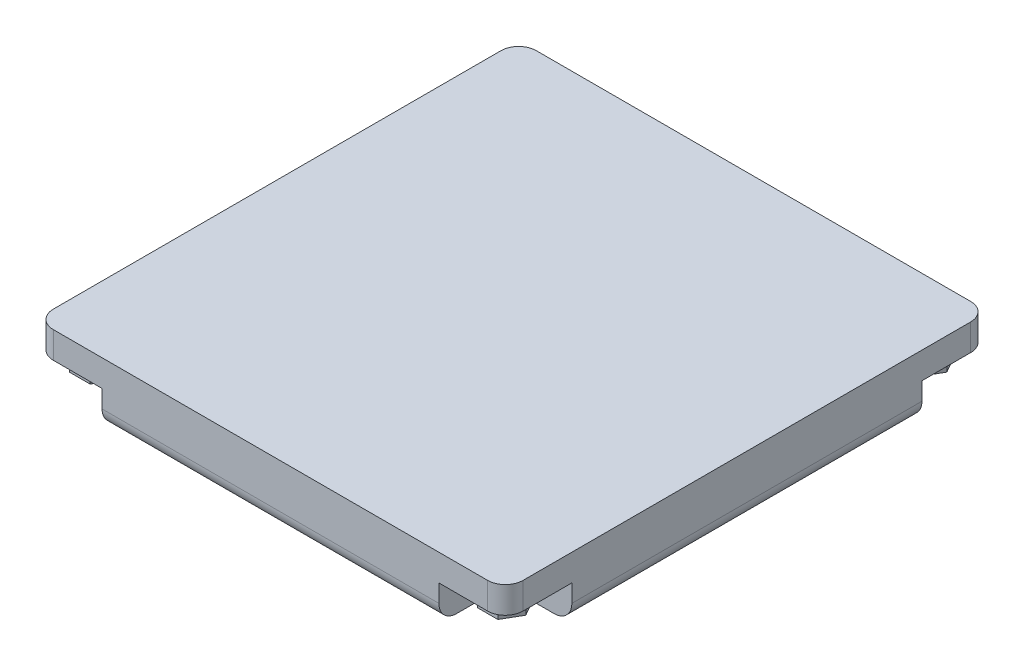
ISO-10303-21;
HEADER;
FILE_DESCRIPTION(('STEP AP214'),'2;1');
FILE_NAME('part.step','',(''),(''),'','','');
FILE_SCHEMA(('AUTOMOTIVE_DESIGN { 1 0 10303 214 1 1 1 1 }'));
ENDSEC;
DATA;
#1=APPLICATION_CONTEXT('core data for automotive mechanical design processes');
#2=APPLICATION_PROTOCOL_DEFINITION('international standard','automotive_design',2000,#1);
#3=PRODUCT_CONTEXT('',#1,'mechanical');
#4=PRODUCT('Part','Part','',(#3));
#5=PRODUCT_RELATED_PRODUCT_CATEGORY('part','',(#4));
#6=PRODUCT_DEFINITION_FORMATION('','',#4);
#7=PRODUCT_DEFINITION_CONTEXT('part definition',#1,'design');
#8=PRODUCT_DEFINITION('design','',#6,#7);
#9=PRODUCT_DEFINITION_SHAPE('','',#8);
#10=(LENGTH_UNIT() NAMED_UNIT(*) SI_UNIT(.MILLI.,.METRE.));
#11=(NAMED_UNIT(*) PLANE_ANGLE_UNIT() SI_UNIT($,.RADIAN.));
#12=(NAMED_UNIT(*) SI_UNIT($,.STERADIAN.) SOLID_ANGLE_UNIT());
#13=UNCERTAINTY_MEASURE_WITH_UNIT(LENGTH_MEASURE(1.E-05),#10,'distance_accuracy_value','');
#14=(GEOMETRIC_REPRESENTATION_CONTEXT(3) GLOBAL_UNCERTAINTY_ASSIGNED_CONTEXT((#13)) GLOBAL_UNIT_ASSIGNED_CONTEXT((#10,
#11,#12)) REPRESENTATION_CONTEXT('',''));
#15=CARTESIAN_POINT('',(0.,0.,0.));
#16=DIRECTION('',(0.,0.,1.));
#17=DIRECTION('',(1.,0.,0.));
#18=AXIS2_PLACEMENT_3D('',#15,#16,#17);
#19=CARTESIAN_POINT('',(657.,-161.5,-61.8999999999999));
#20=DIRECTION('',(0.,-1.,0.));
#21=DIRECTION('',(0.,0.,-1.));
#22=AXIS2_PLACEMENT_3D('',#19,#20,#21);
#23=PLANE('',#22);
#24=DIRECTION('',(-0.5,0.,0.866025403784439));
#25=VECTOR('',#24,1.);
#26=CARTESIAN_POINT('',(654.690598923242,-161.5,-65.8999999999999));
#27=LINE('',#26,#25);
#28=CARTESIAN_POINT('',(654.690598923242,-161.5,-65.8999999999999));
#29=VERTEX_POINT('',#28);
#30=CARTESIAN_POINT('',(652.381197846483,-161.5,-61.8999999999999));
#31=VERTEX_POINT('',#30);
#32=EDGE_CURVE('E1180',#29,#31,#27,.T.);
#33=ORIENTED_EDGE('',*,*,#32,.F.);
#34=DIRECTION('',(-1.,0.,0.));
#35=VECTOR('',#34,1.);
#36=CARTESIAN_POINT('',(659.309401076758,-161.5,-65.8999999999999));
#37=LINE('',#36,#35);
#38=CARTESIAN_POINT('',(659.309401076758,-161.5,-65.8999999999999));
#39=VERTEX_POINT('',#38);
#40=EDGE_CURVE('E1185',#39,#29,#37,.T.);
#41=ORIENTED_EDGE('',*,*,#40,.F.);
#42=DIRECTION('',(-0.5,0.,-0.866025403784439));
#43=VECTOR('',#42,1.);
#44=CARTESIAN_POINT('',(661.618802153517,-161.5,-61.9));
#45=LINE('',#44,#43);
#46=CARTESIAN_POINT('',(661.618802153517,-161.5,-61.9));
#47=VERTEX_POINT('',#46);
#48=EDGE_CURVE('E1200',#47,#39,#45,.T.);
#49=ORIENTED_EDGE('',*,*,#48,.F.);
#50=DIRECTION('',(0.5,0.,-0.866025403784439));
#51=VECTOR('',#50,1.);
#52=CARTESIAN_POINT('',(659.309401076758,-161.5,-57.9));
#53=LINE('',#52,#51);
#54=CARTESIAN_POINT('',(659.309401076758,-161.5,-57.9));
#55=VERTEX_POINT('',#54);
#56=EDGE_CURVE('E1251',#55,#47,#53,.T.);
#57=ORIENTED_EDGE('',*,*,#56,.F.);
#58=DIRECTION('',(1.,0.,0.));
#59=VECTOR('',#58,1.);
#60=CARTESIAN_POINT('',(654.690598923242,-161.5,-57.8999999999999));
#61=LINE('',#60,#59);
#62=CARTESIAN_POINT('',(654.690598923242,-161.5,-57.8999999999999));
#63=VERTEX_POINT('',#62);
#64=EDGE_CURVE('E1246',#63,#55,#61,.T.);
#65=ORIENTED_EDGE('',*,*,#64,.F.);
#66=DIRECTION('',(0.5,0.,0.866025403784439));
#67=VECTOR('',#66,1.);
#68=CARTESIAN_POINT('',(652.381197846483,-161.5,-61.8999999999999));
#69=LINE('',#68,#67);
#70=EDGE_CURVE('E1190',#31,#63,#69,.T.);
#71=ORIENTED_EDGE('',*,*,#70,.F.);
#72=EDGE_LOOP('',(#33,#41,#49,#57,#65,#71));
#73=FACE_BOUND('',#72,.T.);
#74=ADVANCED_FACE('F16',(#73),#23,.T.);
#75=CARTESIAN_POINT('',(657.,-161.5,33.1000000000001));
#76=DIRECTION('',(0.,-1.,0.));
#77=DIRECTION('',(0.,0.,-1.));
#78=AXIS2_PLACEMENT_3D('',#75,#76,#77);
#79=PLANE('',#78);
#80=DIRECTION('',(-0.5,0.,0.866025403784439));
#81=VECTOR('',#80,1.);
#82=CARTESIAN_POINT('',(654.690598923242,-161.5,29.1000000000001));
#83=LINE('',#82,#81);
#84=CARTESIAN_POINT('',(654.690598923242,-161.5,29.1000000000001));
#85=VERTEX_POINT('',#84);
#86=CARTESIAN_POINT('',(652.381197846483,-161.5,33.1000000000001));
#87=VERTEX_POINT('',#86);
#88=EDGE_CURVE('E621',#85,#87,#83,.T.);
#89=ORIENTED_EDGE('',*,*,#88,.F.);
#90=DIRECTION('',(-1.,0.,0.));
#91=VECTOR('',#90,1.);
#92=CARTESIAN_POINT('',(659.309401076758,-161.5,29.1));
#93=LINE('',#92,#91);
#94=CARTESIAN_POINT('',(659.309401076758,-161.5,29.1));
#95=VERTEX_POINT('',#94);
#96=EDGE_CURVE('E622',#95,#85,#93,.T.);
#97=ORIENTED_EDGE('',*,*,#96,.F.);
#98=DIRECTION('',(-0.5,0.,-0.866025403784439));
#99=VECTOR('',#98,1.);
#100=CARTESIAN_POINT('',(661.618802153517,-161.5,33.1000000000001));
#101=LINE('',#100,#99);
#102=CARTESIAN_POINT('',(661.618802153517,-161.5,33.1000000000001));
#103=VERTEX_POINT('',#102);
#104=EDGE_CURVE('E617',#103,#95,#101,.T.);
#105=ORIENTED_EDGE('',*,*,#104,.F.);
#106=DIRECTION('',(0.5,0.,-0.866025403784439));
#107=VECTOR('',#106,1.);
#108=CARTESIAN_POINT('',(659.309401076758,-161.5,37.1));
#109=LINE('',#108,#107);
#110=CARTESIAN_POINT('',(659.309401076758,-161.5,37.1));
#111=VERTEX_POINT('',#110);
#112=EDGE_CURVE('E903',#111,#103,#109,.T.);
#113=ORIENTED_EDGE('',*,*,#112,.F.);
#114=DIRECTION('',(1.,0.,0.));
#115=VECTOR('',#114,1.);
#116=CARTESIAN_POINT('',(654.690598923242,-161.5,37.1000000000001));
#117=LINE('',#116,#115);
#118=CARTESIAN_POINT('',(654.690598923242,-161.5,37.1000000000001));
#119=VERTEX_POINT('',#118);
#120=EDGE_CURVE('E894',#119,#111,#117,.T.);
#121=ORIENTED_EDGE('',*,*,#120,.F.);
#122=DIRECTION('',(0.5,0.,0.866025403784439));
#123=VECTOR('',#122,1.);
#124=CARTESIAN_POINT('',(652.381197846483,-161.5,33.1000000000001));
#125=LINE('',#124,#123);
#126=EDGE_CURVE('E634',#87,#119,#125,.T.);
#127=ORIENTED_EDGE('',*,*,#126,.F.);
#128=EDGE_LOOP('',(#89,#97,#105,#113,#121,#127));
#129=FACE_BOUND('',#128,.T.);
#130=ADVANCED_FACE('F1164',(#129),#79,.T.);
#131=CARTESIAN_POINT('',(565.,-161.5,33.1));
#132=DIRECTION('',(0.,-1.,0.));
#133=DIRECTION('',(0.,0.,-1.));
#134=AXIS2_PLACEMENT_3D('',#131,#132,#133);
#135=PLANE('',#134);
#136=DIRECTION('',(-0.5,0.,0.866025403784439));
#137=VECTOR('',#136,1.);
#138=CARTESIAN_POINT('',(562.690598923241,-161.5,29.1000000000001));
#139=LINE('',#138,#137);
#140=CARTESIAN_POINT('',(562.690598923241,-161.5,29.1000000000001));
#141=VERTEX_POINT('',#140);
#142=CARTESIAN_POINT('',(560.381197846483,-161.5,33.1));
#143=VERTEX_POINT('',#142);
#144=EDGE_CURVE('E914',#141,#143,#139,.T.);
#145=ORIENTED_EDGE('',*,*,#144,.F.);
#146=DIRECTION('',(-1.,0.,0.));
#147=VECTOR('',#146,1.);
#148=CARTESIAN_POINT('',(567.309401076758,-161.5,29.1000000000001));
#149=LINE('',#148,#147);
#150=CARTESIAN_POINT('',(567.309401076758,-161.5,29.1000000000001));
#151=VERTEX_POINT('',#150);
#152=EDGE_CURVE('E910',#151,#141,#149,.T.);
#153=ORIENTED_EDGE('',*,*,#152,.F.);
#154=DIRECTION('',(-0.5,0.,-0.866025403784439));
#155=VECTOR('',#154,1.);
#156=CARTESIAN_POINT('',(569.618802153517,-161.5,33.1000000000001));
#157=LINE('',#156,#155);
#158=CARTESIAN_POINT('',(569.618802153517,-161.5,33.1000000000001));
#159=VERTEX_POINT('',#158);
#160=EDGE_CURVE('E898',#159,#151,#157,.T.);
#161=ORIENTED_EDGE('',*,*,#160,.F.);
#162=DIRECTION('',(0.5,0.,-0.866025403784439));
#163=VECTOR('',#162,1.);
#164=CARTESIAN_POINT('',(567.309401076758,-161.5,37.1000000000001));
#165=LINE('',#164,#163);
#166=CARTESIAN_POINT('',(567.309401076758,-161.5,37.1000000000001));
#167=VERTEX_POINT('',#166);
#168=EDGE_CURVE('E795',#167,#159,#165,.T.);
#169=ORIENTED_EDGE('',*,*,#168,.F.);
#170=DIRECTION('',(1.,0.,0.));
#171=VECTOR('',#170,1.);
#172=CARTESIAN_POINT('',(562.690598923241,-161.5,37.1000000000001));
#173=LINE('',#172,#171);
#174=CARTESIAN_POINT('',(562.690598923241,-161.5,37.1000000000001));
#175=VERTEX_POINT('',#174);
#176=EDGE_CURVE('E785',#175,#167,#173,.T.);
#177=ORIENTED_EDGE('',*,*,#176,.F.);
#178=DIRECTION('',(0.5,0.,0.866025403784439));
#179=VECTOR('',#178,1.);
#180=CARTESIAN_POINT('',(560.381197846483,-161.5,33.1));
#181=LINE('',#180,#179);
#182=EDGE_CURVE('E920',#143,#175,#181,.T.);
#183=ORIENTED_EDGE('',*,*,#182,.F.);
#184=EDGE_LOOP('',(#145,#153,#161,#169,#177,#183));
#185=FACE_BOUND('',#184,.T.);
#186=ADVANCED_FACE('F935',(#185),#135,.T.);
#187=CARTESIAN_POINT('',(565.,-161.5,-61.8999999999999));
#188=DIRECTION('',(0.,-1.,0.));
#189=DIRECTION('',(0.,0.,-1.));
#190=AXIS2_PLACEMENT_3D('',#187,#188,#189);
#191=PLANE('',#190);
#192=DIRECTION('',(-0.5,0.,0.866025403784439));
#193=VECTOR('',#192,1.);
#194=CARTESIAN_POINT('',(562.690598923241,-161.5,-65.8999999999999));
#195=LINE('',#194,#193);
#196=CARTESIAN_POINT('',(562.690598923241,-161.5,-65.8999999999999));
#197=VERTEX_POINT('',#196);
#198=CARTESIAN_POINT('',(560.381197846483,-161.5,-61.9));
#199=VERTEX_POINT('',#198);
#200=EDGE_CURVE('E810',#197,#199,#195,.T.);
#201=ORIENTED_EDGE('',*,*,#200,.F.);
#202=DIRECTION('',(-1.,0.,0.));
#203=VECTOR('',#202,1.);
#204=CARTESIAN_POINT('',(567.309401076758,-161.5,-65.8999999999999));
#205=LINE('',#204,#203);
#206=CARTESIAN_POINT('',(567.309401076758,-161.5,-65.8999999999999));
#207=VERTEX_POINT('',#206);
#208=EDGE_CURVE('E806',#207,#197,#205,.T.);
#209=ORIENTED_EDGE('',*,*,#208,.F.);
#210=DIRECTION('',(-0.5,0.,-0.866025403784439));
#211=VECTOR('',#210,1.);
#212=CARTESIAN_POINT('',(569.618802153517,-161.5,-61.8999999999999));
#213=LINE('',#212,#211);
#214=CARTESIAN_POINT('',(569.618802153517,-161.5,-61.8999999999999));
#215=VERTEX_POINT('',#214);
#216=EDGE_CURVE('E789',#215,#207,#213,.T.);
#217=ORIENTED_EDGE('',*,*,#216,.F.);
#218=DIRECTION('',(0.5,0.,-0.866025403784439));
#219=VECTOR('',#218,1.);
#220=CARTESIAN_POINT('',(567.309401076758,-161.5,-57.8999999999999));
#221=LINE('',#220,#219);
#222=CARTESIAN_POINT('',(567.309401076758,-161.5,-57.8999999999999));
#223=VERTEX_POINT('',#222);
#224=EDGE_CURVE('E543',#223,#215,#221,.T.);
#225=ORIENTED_EDGE('',*,*,#224,.F.);
#226=DIRECTION('',(1.,0.,0.));
#227=VECTOR('',#226,1.);
#228=CARTESIAN_POINT('',(562.690598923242,-161.5,-57.8999999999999));
#229=LINE('',#228,#227);
#230=CARTESIAN_POINT('',(562.690598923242,-161.5,-57.8999999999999));
#231=VERTEX_POINT('',#230);
#232=EDGE_CURVE('E822',#231,#223,#229,.T.);
#233=ORIENTED_EDGE('',*,*,#232,.F.);
#234=DIRECTION('',(0.5,0.,0.866025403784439));
#235=VECTOR('',#234,1.);
#236=CARTESIAN_POINT('',(560.381197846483,-161.5,-61.8999999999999));
#237=LINE('',#236,#235);
#238=EDGE_CURVE('E816',#199,#231,#237,.T.);
#239=ORIENTED_EDGE('',*,*,#238,.F.);
#240=EDGE_LOOP('',(#201,#209,#217,#225,#233,#239));
#241=FACE_BOUND('',#240,.T.);
#242=ADVANCED_FACE('F846',(#241),#191,.T.);
#243=CARTESIAN_POINT('',(659.309401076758,-158.,-57.8999999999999));
#244=DIRECTION('',(0.866025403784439,0.,0.5));
#245=DIRECTION('',(0.5,0.,-0.866025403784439));
#246=AXIS2_PLACEMENT_3D('',#243,#244,#245);
#247=PLANE('',#246);
#248=DIRECTION('',(-0.499999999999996,0.,0.866025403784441));
#249=VECTOR('',#248,1.);
#250=CARTESIAN_POINT('',(661.618802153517,-158.,-61.8999999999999));
#251=LINE('',#250,#249);
#252=CARTESIAN_POINT('',(661.618802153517,-158.,-61.8999999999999));
#253=VERTEX_POINT('',#252);
#254=CARTESIAN_POINT('',(659.309401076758,-158.,-57.8999999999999));
#255=VERTEX_POINT('',#254);
#256=EDGE_CURVE('E551',#253,#255,#251,.T.);
#257=ORIENTED_EDGE('',*,*,#256,.T.);
#258=DIRECTION('',(0.,1.,0.));
#259=VECTOR('',#258,1.);
#260=CARTESIAN_POINT('',(659.309401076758,-158.,-57.8999999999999));
#261=LINE('',#260,#259);
#262=EDGE_CURVE('E1249',#55,#255,#261,.T.);
#263=ORIENTED_EDGE('',*,*,#262,.F.);
#264=ORIENTED_EDGE('',*,*,#56,.T.);
#265=DIRECTION('',(0.,1.,0.));
#266=VECTOR('',#265,1.);
#267=CARTESIAN_POINT('',(661.618802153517,-158.,-61.8999999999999));
#268=LINE('',#267,#266);
#269=EDGE_CURVE('E1208',#253,#47,#268,.F.);
#270=ORIENTED_EDGE('',*,*,#269,.F.);
#271=EDGE_LOOP('',(#257,#263,#264,#270));
#272=FACE_BOUND('',#271,.T.);
#273=ADVANCED_FACE('F1149',(#272),#247,.T.);
#274=CARTESIAN_POINT('',(654.690598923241,-158.,-57.8999999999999));
#275=DIRECTION('',(0.,0.,1.));
#276=DIRECTION('',(1.,0.,0.));
#277=AXIS2_PLACEMENT_3D('',#274,#275,#276);
#278=PLANE('',#277);
#279=DIRECTION('',(1.,0.,0.));
#280=VECTOR('',#279,1.);
#281=CARTESIAN_POINT('',(657.24419635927,-158.,-57.8999999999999));
#282=LINE('',#281,#280);
#283=CARTESIAN_POINT('',(654.690598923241,-158.,-57.8999999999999));
#284=VERTEX_POINT('',#283);
#285=EDGE_CURVE('E572',#255,#284,#282,.F.);
#286=ORIENTED_EDGE('',*,*,#285,.T.);
#287=DIRECTION('',(0.,1.,0.));
#288=VECTOR('',#287,1.);
#289=CARTESIAN_POINT('',(654.690598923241,-158.,-57.8999999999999));
#290=LINE('',#289,#288);
#291=EDGE_CURVE('E1195',#63,#284,#290,.T.);
#292=ORIENTED_EDGE('',*,*,#291,.F.);
#293=ORIENTED_EDGE('',*,*,#64,.T.);
#294=ORIENTED_EDGE('',*,*,#262,.T.);
#295=EDGE_LOOP('',(#286,#292,#293,#294));
#296=FACE_BOUND('',#295,.T.);
#297=ADVANCED_FACE('F1143',(#296),#278,.T.);
#298=CARTESIAN_POINT('',(652.381197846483,-158.,-61.8999999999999));
#299=DIRECTION('',(-0.866025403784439,0.,0.5));
#300=DIRECTION('',(0.5,0.,0.866025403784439));
#301=AXIS2_PLACEMENT_3D('',#298,#299,#300);
#302=PLANE('',#301);
#303=DIRECTION('',(-0.499999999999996,0.,-0.866025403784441));
#304=VECTOR('',#303,1.);
#305=CARTESIAN_POINT('',(654.690598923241,-158.,-57.8999999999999));
#306=LINE('',#305,#304);
#307=CARTESIAN_POINT('',(652.381197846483,-158.,-61.8999999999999));
#308=VERTEX_POINT('',#307);
#309=EDGE_CURVE('E569',#284,#308,#306,.T.);
#310=ORIENTED_EDGE('',*,*,#309,.T.);
#311=DIRECTION('',(0.,1.,0.));
#312=VECTOR('',#311,1.);
#313=CARTESIAN_POINT('',(652.381197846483,-158.,-61.8999999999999));
#314=LINE('',#313,#312);
#315=EDGE_CURVE('E1194',#31,#308,#314,.T.);
#316=ORIENTED_EDGE('',*,*,#315,.F.);
#317=ORIENTED_EDGE('',*,*,#70,.T.);
#318=ORIENTED_EDGE('',*,*,#291,.T.);
#319=EDGE_LOOP('',(#310,#316,#317,#318));
#320=FACE_BOUND('',#319,.T.);
#321=ADVANCED_FACE('F1137',(#320),#302,.T.);
#322=CARTESIAN_POINT('',(654.690598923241,-158.,-65.9));
#323=DIRECTION('',(-0.866025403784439,0.,-0.5));
#324=DIRECTION('',(-0.5,0.,0.866025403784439));
#325=AXIS2_PLACEMENT_3D('',#322,#323,#324);
#326=PLANE('',#325);
#327=DIRECTION('',(0.499999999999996,0.,-0.866025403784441));
#328=VECTOR('',#327,1.);
#329=CARTESIAN_POINT('',(652.381197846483,-158.,-61.8999999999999));
#330=LINE('',#329,#328);
#331=CARTESIAN_POINT('',(654.690598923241,-158.,-65.9));
#332=VERTEX_POINT('',#331);
#333=EDGE_CURVE('E566',#308,#332,#330,.T.);
#334=ORIENTED_EDGE('',*,*,#333,.T.);
#335=DIRECTION('',(0.,1.,0.));
#336=VECTOR('',#335,1.);
#337=CARTESIAN_POINT('',(654.690598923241,-158.,-65.9));
#338=LINE('',#337,#336);
#339=EDGE_CURVE('E1197',#29,#332,#338,.T.);
#340=ORIENTED_EDGE('',*,*,#339,.F.);
#341=ORIENTED_EDGE('',*,*,#32,.T.);
#342=ORIENTED_EDGE('',*,*,#315,.T.);
#343=EDGE_LOOP('',(#334,#340,#341,#342));
#344=FACE_BOUND('',#343,.T.);
#345=ADVANCED_FACE('F1131',(#344),#326,.T.);
#346=CARTESIAN_POINT('',(659.309401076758,-158.,-65.9));
#347=DIRECTION('',(0.,0.,-1.));
#348=DIRECTION('',(-1.,0.,0.));
#349=AXIS2_PLACEMENT_3D('',#346,#347,#348);
#350=PLANE('',#349);
#351=DIRECTION('',(1.,0.,0.));
#352=VECTOR('',#351,1.);
#353=CARTESIAN_POINT('',(657.24419635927,-158.,-65.8999999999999));
#354=LINE('',#353,#352);
#355=CARTESIAN_POINT('',(659.309401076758,-158.,-65.9));
#356=VERTEX_POINT('',#355);
#357=EDGE_CURVE('E563',#332,#356,#354,.T.);
#358=ORIENTED_EDGE('',*,*,#357,.T.);
#359=DIRECTION('',(0.,1.,0.));
#360=VECTOR('',#359,1.);
#361=CARTESIAN_POINT('',(659.309401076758,-158.,-65.8999999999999));
#362=LINE('',#361,#360);
#363=EDGE_CURVE('E1203',#39,#356,#362,.T.);
#364=ORIENTED_EDGE('',*,*,#363,.F.);
#365=ORIENTED_EDGE('',*,*,#40,.T.);
#366=ORIENTED_EDGE('',*,*,#339,.T.);
#367=EDGE_LOOP('',(#358,#364,#365,#366));
#368=FACE_BOUND('',#367,.T.);
#369=ADVANCED_FACE('F1125',(#368),#350,.T.);
#370=CARTESIAN_POINT('',(661.618802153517,-158.,-61.8999999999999));
#371=DIRECTION('',(0.866025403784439,0.,-0.5));
#372=DIRECTION('',(-0.5,0.,-0.866025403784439));
#373=AXIS2_PLACEMENT_3D('',#370,#371,#372);
#374=PLANE('',#373);
#375=DIRECTION('',(0.499999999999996,0.,0.866025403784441));
#376=VECTOR('',#375,1.);
#377=CARTESIAN_POINT('',(659.309401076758,-158.,-65.9));
#378=LINE('',#377,#376);
#379=EDGE_CURVE('E558',#356,#253,#378,.T.);
#380=ORIENTED_EDGE('',*,*,#379,.T.);
#381=ORIENTED_EDGE('',*,*,#269,.T.);
#382=ORIENTED_EDGE('',*,*,#48,.T.);
#383=ORIENTED_EDGE('',*,*,#363,.T.);
#384=EDGE_LOOP('',(#380,#381,#382,#383));
#385=FACE_BOUND('',#384,.T.);
#386=ADVANCED_FACE('F1120',(#385),#374,.T.);
#387=CARTESIAN_POINT('',(653.,-166.,-57.9));
#388=DIRECTION('',(0.,1.,0.));
#389=DIRECTION('',(0.,0.,1.));
#390=AXIS2_PLACEMENT_3D('',#387,#388,#389);
#391=CYLINDRICAL_SURFACE('',#390,4.);
#392=DIRECTION('',(0.,1.,0.));
#393=VECTOR('',#392,1.);
#394=CARTESIAN_POINT('',(653.,-166.,-53.8999999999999));
#395=LINE('',#394,#393);
#396=CARTESIAN_POINT('',(653.,-158.,-53.8999999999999));
#397=VERTEX_POINT('',#396);
#398=CARTESIAN_POINT('',(653.,-166.,-53.8999999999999));
#399=VERTEX_POINT('',#398);
#400=EDGE_CURVE('E479',#397,#399,#395,.F.);
#401=ORIENTED_EDGE('',*,*,#400,.T.);
#402=CARTESIAN_POINT('',(653.,-166.,-57.9));
#403=DIRECTION('',(0.,1.,0.));
#404=DIRECTION('',(0.,0.,1.));
#405=AXIS2_PLACEMENT_3D('',#402,#403,#404);
#406=CIRCLE('',#405,4.);
#407=CARTESIAN_POINT('',(649.,-166.,-57.8999999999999));
#408=VERTEX_POINT('',#407);
#409=EDGE_CURVE('E453',#408,#399,#406,.T.);
#410=ORIENTED_EDGE('',*,*,#409,.F.);
#411=DIRECTION('',(0.,1.,0.));
#412=VECTOR('',#411,1.);
#413=CARTESIAN_POINT('',(649.,-166.,-57.8999999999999));
#414=LINE('',#413,#412);
#415=CARTESIAN_POINT('',(649.,-158.,-57.8999999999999));
#416=VERTEX_POINT('',#415);
#417=EDGE_CURVE('E484',#408,#416,#414,.T.);
#418=ORIENTED_EDGE('',*,*,#417,.T.);
#419=CARTESIAN_POINT('',(653.,-158.,-57.8999999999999));
#420=DIRECTION('',(0.,1.,0.));
#421=DIRECTION('',(0.,0.,1.));
#422=AXIS2_PLACEMENT_3D('',#419,#420,#421);
#423=CIRCLE('',#422,4.);
#424=EDGE_CURVE('E526',#416,#397,#423,.T.);
#425=ORIENTED_EDGE('',*,*,#424,.T.);
#426=EDGE_LOOP('',(#401,#410,#418,#425));
#427=FACE_BOUND('',#426,.T.);
#428=ADVANCED_FACE('F748',(#427),#391,.F.);
#429=CARTESIAN_POINT('',(661.618802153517,-158.,33.1000000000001));
#430=DIRECTION('',(0.866025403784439,0.,-0.5));
#431=DIRECTION('',(-0.5,0.,-0.866025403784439));
#432=AXIS2_PLACEMENT_3D('',#429,#430,#431);
#433=PLANE('',#432);
#434=DIRECTION('',(-0.499999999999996,0.,-0.866025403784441));
#435=VECTOR('',#434,1.);
#436=CARTESIAN_POINT('',(661.618802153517,-158.,33.1000000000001));
#437=LINE('',#436,#435);
#438=CARTESIAN_POINT('',(661.618802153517,-158.,33.1000000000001));
#439=VERTEX_POINT('',#438);
#440=CARTESIAN_POINT('',(659.309401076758,-158.,29.1));
#441=VERTEX_POINT('',#440);
#442=EDGE_CURVE('E248',#439,#441,#437,.T.);
#443=ORIENTED_EDGE('',*,*,#442,.F.);
#444=DIRECTION('',(0.,1.,0.));
#445=VECTOR('',#444,1.);
#446=CARTESIAN_POINT('',(661.618802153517,-158.,33.1000000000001));
#447=LINE('',#446,#445);
#448=EDGE_CURVE('E899',#103,#439,#447,.T.);
#449=ORIENTED_EDGE('',*,*,#448,.F.);
#450=ORIENTED_EDGE('',*,*,#104,.T.);
#451=DIRECTION('',(0.,1.,0.));
#452=VECTOR('',#451,1.);
#453=CARTESIAN_POINT('',(659.309401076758,-158.,29.1));
#454=LINE('',#453,#452);
#455=EDGE_CURVE('E613',#441,#95,#454,.F.);
#456=ORIENTED_EDGE('',*,*,#455,.F.);
#457=EDGE_LOOP('',(#443,#449,#450,#456));
#458=FACE_BOUND('',#457,.T.);
#459=ADVANCED_FACE('F614',(#458),#433,.T.);
#460=CARTESIAN_POINT('',(659.309401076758,-158.,29.1));
#461=DIRECTION('',(0.,0.,-1.));
#462=DIRECTION('',(-1.,0.,0.));
#463=AXIS2_PLACEMENT_3D('',#460,#461,#462);
#464=PLANE('',#463);
#465=DIRECTION('',(1.,0.,0.));
#466=VECTOR('',#465,1.);
#467=CARTESIAN_POINT('',(657.24419635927,-158.,29.1000000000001));
#468=LINE('',#467,#466);
#469=CARTESIAN_POINT('',(654.690598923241,-158.,29.1000000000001));
#470=VERTEX_POINT('',#469);
#471=EDGE_CURVE('E596',#441,#470,#468,.F.);
#472=ORIENTED_EDGE('',*,*,#471,.F.);
#473=ORIENTED_EDGE('',*,*,#455,.T.);
#474=ORIENTED_EDGE('',*,*,#96,.T.);
#475=DIRECTION('',(0.,1.,0.));
#476=VECTOR('',#475,1.);
#477=CARTESIAN_POINT('',(654.690598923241,-158.,29.1000000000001));
#478=LINE('',#477,#476);
#479=EDGE_CURVE('E626',#470,#85,#478,.F.);
#480=ORIENTED_EDGE('',*,*,#479,.F.);
#481=EDGE_LOOP('',(#472,#473,#474,#480));
#482=FACE_BOUND('',#481,.T.);
#483=ADVANCED_FACE('F624',(#482),#464,.T.);
#484=CARTESIAN_POINT('',(654.690598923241,-158.,29.1000000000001));
#485=DIRECTION('',(-0.866025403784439,0.,-0.5));
#486=DIRECTION('',(-0.5,0.,0.866025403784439));
#487=AXIS2_PLACEMENT_3D('',#484,#485,#486);
#488=PLANE('',#487);
#489=DIRECTION('',(-0.499999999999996,0.,0.866025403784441));
#490=VECTOR('',#489,1.);
#491=CARTESIAN_POINT('',(654.690598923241,-158.,29.1000000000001));
#492=LINE('',#491,#490);
#493=CARTESIAN_POINT('',(652.381197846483,-158.,33.1));
#494=VERTEX_POINT('',#493);
#495=EDGE_CURVE('E594',#470,#494,#492,.T.);
#496=ORIENTED_EDGE('',*,*,#495,.F.);
#497=ORIENTED_EDGE('',*,*,#479,.T.);
#498=ORIENTED_EDGE('',*,*,#88,.T.);
#499=DIRECTION('',(0.,1.,0.));
#500=VECTOR('',#499,1.);
#501=CARTESIAN_POINT('',(652.381197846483,-158.,33.1));
#502=LINE('',#501,#500);
#503=EDGE_CURVE('E639',#494,#87,#502,.F.);
#504=ORIENTED_EDGE('',*,*,#503,.F.);
#505=EDGE_LOOP('',(#496,#497,#498,#504));
#506=FACE_BOUND('',#505,.T.);
#507=ADVANCED_FACE('F637',(#506),#488,.T.);
#508=CARTESIAN_POINT('',(652.381197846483,-158.,33.1));
#509=DIRECTION('',(-0.866025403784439,0.,0.5));
#510=DIRECTION('',(0.5,0.,0.866025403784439));
#511=AXIS2_PLACEMENT_3D('',#508,#509,#510);
#512=PLANE('',#511);
#513=DIRECTION('',(0.499999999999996,0.,0.866025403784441));
#514=VECTOR('',#513,1.);
#515=CARTESIAN_POINT('',(652.381197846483,-158.,33.1));
#516=LINE('',#515,#514);
#517=CARTESIAN_POINT('',(654.690598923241,-158.,37.1));
#518=VERTEX_POINT('',#517);
#519=EDGE_CURVE('E591',#494,#518,#516,.T.);
#520=ORIENTED_EDGE('',*,*,#519,.F.);
#521=ORIENTED_EDGE('',*,*,#503,.T.);
#522=ORIENTED_EDGE('',*,*,#126,.T.);
#523=DIRECTION('',(0.,1.,0.));
#524=VECTOR('',#523,1.);
#525=CARTESIAN_POINT('',(654.690598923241,-158.,37.1));
#526=LINE('',#525,#524);
#527=EDGE_CURVE('E905',#518,#119,#526,.F.);
#528=ORIENTED_EDGE('',*,*,#527,.F.);
#529=EDGE_LOOP('',(#520,#521,#522,#528));
#530=FACE_BOUND('',#529,.T.);
#531=ADVANCED_FACE('F1098',(#530),#512,.T.);
#532=CARTESIAN_POINT('',(654.690598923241,-158.,37.1));
#533=DIRECTION('',(0.,0.,1.));
#534=DIRECTION('',(1.,0.,0.));
#535=AXIS2_PLACEMENT_3D('',#532,#533,#534);
#536=PLANE('',#535);
#537=DIRECTION('',(1.,0.,0.));
#538=VECTOR('',#537,1.);
#539=CARTESIAN_POINT('',(657.24419635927,-158.,37.1));
#540=LINE('',#539,#538);
#541=CARTESIAN_POINT('',(659.309401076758,-158.,37.1));
#542=VERTEX_POINT('',#541);
#543=EDGE_CURVE('E588',#518,#542,#540,.T.);
#544=ORIENTED_EDGE('',*,*,#543,.F.);
#545=ORIENTED_EDGE('',*,*,#527,.T.);
#546=ORIENTED_EDGE('',*,*,#120,.T.);
#547=DIRECTION('',(0.,1.,0.));
#548=VECTOR('',#547,1.);
#549=CARTESIAN_POINT('',(659.309401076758,-158.,37.1));
#550=LINE('',#549,#548);
#551=EDGE_CURVE('E890',#542,#111,#550,.F.);
#552=ORIENTED_EDGE('',*,*,#551,.F.);
#553=EDGE_LOOP('',(#544,#545,#546,#552));
#554=FACE_BOUND('',#553,.T.);
#555=ADVANCED_FACE('F891',(#554),#536,.T.);
#556=CARTESIAN_POINT('',(659.309401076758,-158.,37.1));
#557=DIRECTION('',(0.866025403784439,0.,0.5));
#558=DIRECTION('',(0.5,0.,-0.866025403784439));
#559=AXIS2_PLACEMENT_3D('',#556,#557,#558);
#560=PLANE('',#559);
#561=DIRECTION('',(0.499999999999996,0.,-0.866025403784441));
#562=VECTOR('',#561,1.);
#563=CARTESIAN_POINT('',(659.309401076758,-158.,37.1));
#564=LINE('',#563,#562);
#565=EDGE_CURVE('E583',#542,#439,#564,.T.);
#566=ORIENTED_EDGE('',*,*,#565,.F.);
#567=ORIENTED_EDGE('',*,*,#551,.T.);
#568=ORIENTED_EDGE('',*,*,#112,.T.);
#569=ORIENTED_EDGE('',*,*,#448,.T.);
#570=EDGE_LOOP('',(#566,#567,#568,#569));
#571=FACE_BOUND('',#570,.T.);
#572=ADVANCED_FACE('F901',(#571),#560,.T.);
#573=CARTESIAN_POINT('',(653.,-158.,29.1000000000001));
#574=DIRECTION('',(0.,-1.,0.));
#575=DIRECTION('',(0.,0.,-1.));
#576=AXIS2_PLACEMENT_3D('',#573,#574,#575);
#577=CYLINDRICAL_SURFACE('',#576,4.);
#578=DIRECTION('',(0.,1.,0.));
#579=VECTOR('',#578,1.);
#580=CARTESIAN_POINT('',(653.,-158.,25.1000000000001));
#581=LINE('',#580,#579);
#582=CARTESIAN_POINT('',(653.,-166.,25.1000000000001));
#583=VERTEX_POINT('',#582);
#584=CARTESIAN_POINT('',(653.,-158.,25.1000000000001));
#585=VERTEX_POINT('',#584);
#586=EDGE_CURVE('E458',#583,#585,#581,.T.);
#587=ORIENTED_EDGE('',*,*,#586,.T.);
#588=CARTESIAN_POINT('',(653.,-158.,29.1000000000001));
#589=DIRECTION('',(0.,-1.,0.));
#590=DIRECTION('',(0.,0.,-1.));
#591=AXIS2_PLACEMENT_3D('',#588,#589,#590);
#592=CIRCLE('',#591,4.);
#593=CARTESIAN_POINT('',(649.,-158.,29.1000000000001));
#594=VERTEX_POINT('',#593);
#595=EDGE_CURVE('E244',#594,#585,#592,.T.);
#596=ORIENTED_EDGE('',*,*,#595,.F.);
#597=DIRECTION('',(0.,1.,0.));
#598=VECTOR('',#597,1.);
#599=CARTESIAN_POINT('',(649.,-158.,29.1000000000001));
#600=LINE('',#599,#598);
#601=CARTESIAN_POINT('',(649.,-166.,29.1000000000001));
#602=VERTEX_POINT('',#601);
#603=EDGE_CURVE('E463',#594,#602,#600,.F.);
#604=ORIENTED_EDGE('',*,*,#603,.T.);
#605=CARTESIAN_POINT('',(653.,-166.,29.1000000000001));
#606=DIRECTION('',(0.,-1.,0.));
#607=DIRECTION('',(0.,0.,-1.));
#608=AXIS2_PLACEMENT_3D('',#605,#606,#607);
#609=CIRCLE('',#608,4.);
#610=EDGE_CURVE('E225',#583,#602,#609,.F.);
#611=ORIENTED_EDGE('',*,*,#610,.F.);
#612=EDGE_LOOP('',(#587,#596,#604,#611));
#613=FACE_BOUND('',#612,.T.);
#614=ADVANCED_FACE('F1084',(#613),#577,.F.);
#615=CARTESIAN_POINT('',(569.618802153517,-158.,33.1000000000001));
#616=DIRECTION('',(0.866025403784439,0.,-0.5));
#617=DIRECTION('',(-0.5,0.,-0.866025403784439));
#618=AXIS2_PLACEMENT_3D('',#615,#616,#617);
#619=PLANE('',#618);
#620=DIRECTION('',(-0.499999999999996,0.,-0.866025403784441));
#621=VECTOR('',#620,1.);
#622=CARTESIAN_POINT('',(569.618802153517,-158.,33.1000000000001));
#623=LINE('',#622,#621);
#624=CARTESIAN_POINT('',(569.618802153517,-158.,33.1000000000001));
#625=VERTEX_POINT('',#624);
#626=CARTESIAN_POINT('',(567.309401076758,-158.,29.1000000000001));
#627=VERTEX_POINT('',#626);
#628=EDGE_CURVE('E252',#625,#627,#623,.T.);
#629=ORIENTED_EDGE('',*,*,#628,.F.);
#630=DIRECTION('',(0.,1.,0.));
#631=VECTOR('',#630,1.);
#632=CARTESIAN_POINT('',(569.618802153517,-158.,33.1000000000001));
#633=LINE('',#632,#631);
#634=EDGE_CURVE('E790',#159,#625,#633,.T.);
#635=ORIENTED_EDGE('',*,*,#634,.F.);
#636=ORIENTED_EDGE('',*,*,#160,.T.);
#637=DIRECTION('',(0.,1.,0.));
#638=VECTOR('',#637,1.);
#639=CARTESIAN_POINT('',(567.309401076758,-158.,29.1000000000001));
#640=LINE('',#639,#638);
#641=EDGE_CURVE('E911',#627,#151,#640,.F.);
#642=ORIENTED_EDGE('',*,*,#641,.F.);
#643=EDGE_LOOP('',(#629,#635,#636,#642));
#644=FACE_BOUND('',#643,.T.);
#645=ADVANCED_FACE('F1078',(#644),#619,.T.);
#646=CARTESIAN_POINT('',(567.309401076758,-158.,29.1000000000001));
#647=DIRECTION('',(0.,0.,-1.));
#648=DIRECTION('',(-1.,0.,0.));
#649=AXIS2_PLACEMENT_3D('',#646,#647,#648);
#650=PLANE('',#649);
#651=DIRECTION('',(1.,0.,0.));
#652=VECTOR('',#651,1.);
#653=CARTESIAN_POINT('',(564.75580364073,-158.,29.1000000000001));
#654=LINE('',#653,#652);
#655=CARTESIAN_POINT('',(562.690598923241,-158.,29.1000000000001));
#656=VERTEX_POINT('',#655);
#657=EDGE_CURVE('E275',#627,#656,#654,.F.);
#658=ORIENTED_EDGE('',*,*,#657,.F.);
#659=ORIENTED_EDGE('',*,*,#641,.T.);
#660=ORIENTED_EDGE('',*,*,#152,.T.);
#661=DIRECTION('',(0.,1.,0.));
#662=VECTOR('',#661,1.);
#663=CARTESIAN_POINT('',(562.690598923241,-158.,29.1000000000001));
#664=LINE('',#663,#662);
#665=EDGE_CURVE('E917',#656,#141,#664,.F.);
#666=ORIENTED_EDGE('',*,*,#665,.F.);
#667=EDGE_LOOP('',(#658,#659,#660,#666));
#668=FACE_BOUND('',#667,.T.);
#669=ADVANCED_FACE('F1072',(#668),#650,.T.);
#670=CARTESIAN_POINT('',(562.690598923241,-158.,29.1000000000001));
#671=DIRECTION('',(-0.866025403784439,0.,-0.5));
#672=DIRECTION('',(-0.5,0.,0.866025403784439));
#673=AXIS2_PLACEMENT_3D('',#670,#671,#672);
#674=PLANE('',#673);
#675=DIRECTION('',(-0.499999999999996,0.,0.866025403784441));
#676=VECTOR('',#675,1.);
#677=CARTESIAN_POINT('',(562.690598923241,-158.,29.1000000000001));
#678=LINE('',#677,#676);
#679=CARTESIAN_POINT('',(560.381197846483,-158.,33.1));
#680=VERTEX_POINT('',#679);
#681=EDGE_CURVE('E272',#656,#680,#678,.T.);
#682=ORIENTED_EDGE('',*,*,#681,.F.);
#683=ORIENTED_EDGE('',*,*,#665,.T.);
#684=ORIENTED_EDGE('',*,*,#144,.T.);
#685=DIRECTION('',(0.,1.,0.));
#686=VECTOR('',#685,1.);
#687=CARTESIAN_POINT('',(560.381197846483,-158.,33.1));
#688=LINE('',#687,#686);
#689=EDGE_CURVE('E923',#680,#143,#688,.F.);
#690=ORIENTED_EDGE('',*,*,#689,.F.);
#691=EDGE_LOOP('',(#682,#683,#684,#690));
#692=FACE_BOUND('',#691,.T.);
#693=ADVANCED_FACE('F1067',(#692),#674,.T.);
#694=CARTESIAN_POINT('',(560.381197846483,-158.,33.1));
#695=DIRECTION('',(-0.866025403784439,0.,0.5));
#696=DIRECTION('',(0.5,0.,0.866025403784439));
#697=AXIS2_PLACEMENT_3D('',#694,#695,#696);
#698=PLANE('',#697);
#699=DIRECTION('',(0.499999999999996,0.,0.866025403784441));
#700=VECTOR('',#699,1.);
#701=CARTESIAN_POINT('',(560.381197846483,-158.,33.1));
#702=LINE('',#701,#700);
#703=CARTESIAN_POINT('',(562.690598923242,-158.,37.1));
#704=VERTEX_POINT('',#703);
#705=EDGE_CURVE('E269',#680,#704,#702,.T.);
#706=ORIENTED_EDGE('',*,*,#705,.F.);
#707=ORIENTED_EDGE('',*,*,#689,.T.);
#708=ORIENTED_EDGE('',*,*,#182,.T.);
#709=DIRECTION('',(0.,1.,0.));
#710=VECTOR('',#709,1.);
#711=CARTESIAN_POINT('',(562.690598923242,-158.,37.1));
#712=LINE('',#711,#710);
#713=EDGE_CURVE('E800',#704,#175,#712,.F.);
#714=ORIENTED_EDGE('',*,*,#713,.F.);
#715=EDGE_LOOP('',(#706,#707,#708,#714));
#716=FACE_BOUND('',#715,.T.);
#717=ADVANCED_FACE('F1062',(#716),#698,.T.);
#718=CARTESIAN_POINT('',(562.690598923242,-158.,37.1));
#719=DIRECTION('',(0.,0.,1.));
#720=DIRECTION('',(1.,0.,0.));
#721=AXIS2_PLACEMENT_3D('',#718,#719,#720);
#722=PLANE('',#721);
#723=DIRECTION('',(1.,0.,0.));
#724=VECTOR('',#723,1.);
#725=CARTESIAN_POINT('',(564.75580364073,-158.,37.1));
#726=LINE('',#725,#724);
#727=CARTESIAN_POINT('',(567.309401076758,-158.,37.1));
#728=VERTEX_POINT('',#727);
#729=EDGE_CURVE('E266',#704,#728,#726,.T.);
#730=ORIENTED_EDGE('',*,*,#729,.F.);
#731=ORIENTED_EDGE('',*,*,#713,.T.);
#732=ORIENTED_EDGE('',*,*,#176,.T.);
#733=DIRECTION('',(0.,1.,0.));
#734=VECTOR('',#733,1.);
#735=CARTESIAN_POINT('',(567.309401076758,-158.,37.1));
#736=LINE('',#735,#734);
#737=EDGE_CURVE('E781',#728,#167,#736,.F.);
#738=ORIENTED_EDGE('',*,*,#737,.F.);
#739=EDGE_LOOP('',(#730,#731,#732,#738));
#740=FACE_BOUND('',#739,.T.);
#741=ADVANCED_FACE('F782',(#740),#722,.T.);
#742=CARTESIAN_POINT('',(567.309401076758,-158.,37.1));
#743=DIRECTION('',(0.866025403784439,0.,0.5));
#744=DIRECTION('',(0.5,0.,-0.866025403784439));
#745=AXIS2_PLACEMENT_3D('',#742,#743,#744);
#746=PLANE('',#745);
#747=DIRECTION('',(0.499999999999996,0.,-0.866025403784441));
#748=VECTOR('',#747,1.);
#749=CARTESIAN_POINT('',(567.309401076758,-158.,37.1));
#750=LINE('',#749,#748);
#751=EDGE_CURVE('E261',#728,#625,#750,.T.);
#752=ORIENTED_EDGE('',*,*,#751,.F.);
#753=ORIENTED_EDGE('',*,*,#737,.T.);
#754=ORIENTED_EDGE('',*,*,#168,.T.);
#755=ORIENTED_EDGE('',*,*,#634,.T.);
#756=EDGE_LOOP('',(#752,#753,#754,#755));
#757=FACE_BOUND('',#756,.T.);
#758=ADVANCED_FACE('F792',(#757),#746,.T.);
#759=CARTESIAN_POINT('',(569.,-158.,29.1000000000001));
#760=DIRECTION('',(0.,-1.,0.));
#761=DIRECTION('',(0.,0.,-1.));
#762=AXIS2_PLACEMENT_3D('',#759,#760,#761);
#763=CYLINDRICAL_SURFACE('',#762,4.);
#764=DIRECTION('',(0.,1.,0.));
#765=VECTOR('',#764,1.);
#766=CARTESIAN_POINT('',(573.,-158.,29.1000000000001));
#767=LINE('',#766,#765);
#768=CARTESIAN_POINT('',(573.,-166.,29.1000000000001));
#769=VERTEX_POINT('',#768);
#770=CARTESIAN_POINT('',(573.,-158.,29.1000000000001));
#771=VERTEX_POINT('',#770);
#772=EDGE_CURVE('E219',#769,#771,#767,.T.);
#773=ORIENTED_EDGE('',*,*,#772,.T.);
#774=CARTESIAN_POINT('',(569.,-158.,29.1000000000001));
#775=DIRECTION('',(0.,-1.,0.));
#776=DIRECTION('',(0.,0.,-1.));
#777=AXIS2_PLACEMENT_3D('',#774,#775,#776);
#778=CIRCLE('',#777,4.);
#779=CARTESIAN_POINT('',(569.,-158.,25.1000000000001));
#780=VERTEX_POINT('',#779);
#781=EDGE_CURVE('E255',#780,#771,#778,.T.);
#782=ORIENTED_EDGE('',*,*,#781,.F.);
#783=DIRECTION('',(0.,1.,0.));
#784=VECTOR('',#783,1.);
#785=CARTESIAN_POINT('',(569.,-158.,25.1000000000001));
#786=LINE('',#785,#784);
#787=CARTESIAN_POINT('',(569.,-166.,25.1000000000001));
#788=VERTEX_POINT('',#787);
#789=EDGE_CURVE('E221',#780,#788,#786,.F.);
#790=ORIENTED_EDGE('',*,*,#789,.T.);
#791=CARTESIAN_POINT('',(569.,-166.,29.1000000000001));
#792=DIRECTION('',(0.,-1.,0.));
#793=DIRECTION('',(0.,0.,-1.));
#794=AXIS2_PLACEMENT_3D('',#791,#792,#793);
#795=CIRCLE('',#794,4.);
#796=EDGE_CURVE('E20',#769,#788,#795,.F.);
#797=ORIENTED_EDGE('',*,*,#796,.F.);
#798=EDGE_LOOP('',(#773,#782,#790,#797));
#799=FACE_BOUND('',#798,.T.);
#800=ADVANCED_FACE('F217',(#799),#763,.F.);
#801=CARTESIAN_POINT('',(569.618802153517,-158.,-61.8999999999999));
#802=DIRECTION('',(0.866025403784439,0.,-0.5));
#803=DIRECTION('',(-0.5,0.,-0.866025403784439));
#804=AXIS2_PLACEMENT_3D('',#801,#802,#803);
#805=PLANE('',#804);
#806=DIRECTION('',(-0.499999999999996,0.,-0.866025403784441));
#807=VECTOR('',#806,1.);
#808=CARTESIAN_POINT('',(569.618802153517,-158.,-61.8999999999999));
#809=LINE('',#808,#807);
#810=CARTESIAN_POINT('',(569.618802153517,-158.,-61.8999999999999));
#811=VERTEX_POINT('',#810);
#812=CARTESIAN_POINT('',(567.309401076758,-158.,-65.8999999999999));
#813=VERTEX_POINT('',#812);
#814=EDGE_CURVE('E254',#811,#813,#809,.T.);
#815=ORIENTED_EDGE('',*,*,#814,.F.);
#816=DIRECTION('',(0.,1.,0.));
#817=VECTOR('',#816,1.);
#818=CARTESIAN_POINT('',(569.618802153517,-158.,-61.8999999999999));
#819=LINE('',#818,#817);
#820=EDGE_CURVE('E831',#215,#811,#819,.T.);
#821=ORIENTED_EDGE('',*,*,#820,.F.);
#822=ORIENTED_EDGE('',*,*,#216,.T.);
#823=DIRECTION('',(0.,1.,0.));
#824=VECTOR('',#823,1.);
#825=CARTESIAN_POINT('',(567.309401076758,-158.,-65.8999999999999));
#826=LINE('',#825,#824);
#827=EDGE_CURVE('E807',#813,#207,#826,.F.);
#828=ORIENTED_EDGE('',*,*,#827,.F.);
#829=EDGE_LOOP('',(#815,#821,#822,#828));
#830=FACE_BOUND('',#829,.T.);
#831=ADVANCED_FACE('F851',(#830),#805,.T.);
#832=CARTESIAN_POINT('',(567.309401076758,-158.,-65.8999999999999));
#833=DIRECTION('',(0.,0.,-1.));
#834=DIRECTION('',(-1.,0.,0.));
#835=AXIS2_PLACEMENT_3D('',#832,#833,#834);
#836=PLANE('',#835);
#837=DIRECTION('',(1.,0.,0.));
#838=VECTOR('',#837,1.);
#839=CARTESIAN_POINT('',(564.75580364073,-158.,-65.9));
#840=LINE('',#839,#838);
#841=CARTESIAN_POINT('',(562.690598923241,-158.,-65.9));
#842=VERTEX_POINT('',#841);
#843=EDGE_CURVE('E298',#813,#842,#840,.F.);
#844=ORIENTED_EDGE('',*,*,#843,.F.);
#845=ORIENTED_EDGE('',*,*,#827,.T.);
#846=ORIENTED_EDGE('',*,*,#208,.T.);
#847=DIRECTION('',(0.,1.,0.));
#848=VECTOR('',#847,1.);
#849=CARTESIAN_POINT('',(562.690598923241,-158.,-65.9));
#850=LINE('',#849,#848);
#851=EDGE_CURVE('E813',#842,#197,#850,.F.);
#852=ORIENTED_EDGE('',*,*,#851,.F.);
#853=EDGE_LOOP('',(#844,#845,#846,#852));
#854=FACE_BOUND('',#853,.T.);
#855=ADVANCED_FACE('F942',(#854),#836,.T.);
#856=CARTESIAN_POINT('',(562.690598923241,-158.,-65.9));
#857=DIRECTION('',(-0.866025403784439,0.,-0.5));
#858=DIRECTION('',(-0.5,0.,0.866025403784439));
#859=AXIS2_PLACEMENT_3D('',#856,#857,#858);
#860=PLANE('',#859);
#861=DIRECTION('',(-0.499999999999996,0.,0.866025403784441));
#862=VECTOR('',#861,1.);
#863=CARTESIAN_POINT('',(562.690598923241,-158.,-65.9));
#864=LINE('',#863,#862);
#865=CARTESIAN_POINT('',(560.381197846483,-158.,-61.8999999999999));
#866=VERTEX_POINT('',#865);
#867=EDGE_CURVE('E295',#842,#866,#864,.T.);
#868=ORIENTED_EDGE('',*,*,#867,.F.);
#869=ORIENTED_EDGE('',*,*,#851,.T.);
#870=ORIENTED_EDGE('',*,*,#200,.T.);
#871=DIRECTION('',(0.,1.,0.));
#872=VECTOR('',#871,1.);
#873=CARTESIAN_POINT('',(560.381197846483,-158.,-61.8999999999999));
#874=LINE('',#873,#872);
#875=EDGE_CURVE('E819',#866,#199,#874,.F.);
#876=ORIENTED_EDGE('',*,*,#875,.F.);
#877=EDGE_LOOP('',(#868,#869,#870,#876));
#878=FACE_BOUND('',#877,.T.);
#879=ADVANCED_FACE('F945',(#878),#860,.T.);
#880=CARTESIAN_POINT('',(560.381197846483,-158.,-61.8999999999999));
#881=DIRECTION('',(-0.866025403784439,0.,0.5));
#882=DIRECTION('',(0.5,0.,0.866025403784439));
#883=AXIS2_PLACEMENT_3D('',#880,#881,#882);
#884=PLANE('',#883);
#885=DIRECTION('',(0.499999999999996,0.,0.866025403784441));
#886=VECTOR('',#885,1.);
#887=CARTESIAN_POINT('',(560.381197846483,-158.,-61.8999999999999));
#888=LINE('',#887,#886);
#889=CARTESIAN_POINT('',(562.690598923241,-158.,-57.8999999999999));
#890=VERTEX_POINT('',#889);
#891=EDGE_CURVE('E292',#866,#890,#888,.T.);
#892=ORIENTED_EDGE('',*,*,#891,.F.);
#893=ORIENTED_EDGE('',*,*,#875,.T.);
#894=ORIENTED_EDGE('',*,*,#238,.T.);
#895=DIRECTION('',(0.,1.,0.));
#896=VECTOR('',#895,1.);
#897=CARTESIAN_POINT('',(562.690598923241,-158.,-57.8999999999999));
#898=LINE('',#897,#896);
#899=EDGE_CURVE('E825',#890,#231,#898,.F.);
#900=ORIENTED_EDGE('',*,*,#899,.F.);
#901=EDGE_LOOP('',(#892,#893,#894,#900));
#902=FACE_BOUND('',#901,.T.);
#903=ADVANCED_FACE('F947',(#902),#884,.T.);
#904=CARTESIAN_POINT('',(562.690598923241,-158.,-57.8999999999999));
#905=DIRECTION('',(0.,0.,1.));
#906=DIRECTION('',(1.,0.,0.));
#907=AXIS2_PLACEMENT_3D('',#904,#905,#906);
#908=PLANE('',#907);
#909=DIRECTION('',(1.,0.,0.));
#910=VECTOR('',#909,1.);
#911=CARTESIAN_POINT('',(564.75580364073,-158.,-57.8999999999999));
#912=LINE('',#911,#910);
#913=CARTESIAN_POINT('',(567.309401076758,-158.,-57.8999999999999));
#914=VERTEX_POINT('',#913);
#915=EDGE_CURVE('E289',#890,#914,#912,.T.);
#916=ORIENTED_EDGE('',*,*,#915,.F.);
#917=ORIENTED_EDGE('',*,*,#899,.T.);
#918=ORIENTED_EDGE('',*,*,#232,.T.);
#919=DIRECTION('',(0.,1.,0.));
#920=VECTOR('',#919,1.);
#921=CARTESIAN_POINT('',(567.309401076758,-158.,-57.8999999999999));
#922=LINE('',#921,#920);
#923=EDGE_CURVE('E226',#914,#223,#922,.F.);
#924=ORIENTED_EDGE('',*,*,#923,.F.);
#925=EDGE_LOOP('',(#916,#917,#918,#924));
#926=FACE_BOUND('',#925,.T.);
#927=ADVANCED_FACE('F858',(#926),#908,.T.);
#928=CARTESIAN_POINT('',(567.309401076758,-158.,-57.8999999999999));
#929=DIRECTION('',(0.866025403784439,0.,0.5));
#930=DIRECTION('',(0.5,0.,-0.866025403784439));
#931=AXIS2_PLACEMENT_3D('',#928,#929,#930);
#932=PLANE('',#931);
#933=DIRECTION('',(0.499999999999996,0.,-0.866025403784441));
#934=VECTOR('',#933,1.);
#935=CARTESIAN_POINT('',(567.309401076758,-158.,-57.8999999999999));
#936=LINE('',#935,#934);
#937=EDGE_CURVE('E284',#914,#811,#936,.T.);
#938=ORIENTED_EDGE('',*,*,#937,.F.);
#939=ORIENTED_EDGE('',*,*,#923,.T.);
#940=ORIENTED_EDGE('',*,*,#224,.T.);
#941=ORIENTED_EDGE('',*,*,#820,.T.);
#942=EDGE_LOOP('',(#938,#939,#940,#941));
#943=FACE_BOUND('',#942,.T.);
#944=ADVANCED_FACE('F838',(#943),#932,.T.);
#945=CARTESIAN_POINT('',(569.,-158.,-57.8999999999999));
#946=DIRECTION('',(0.,-1.,0.));
#947=DIRECTION('',(0.,0.,-1.));
#948=AXIS2_PLACEMENT_3D('',#945,#946,#947);
#949=CYLINDRICAL_SURFACE('',#948,4.);
#950=DIRECTION('',(0.,1.,0.));
#951=VECTOR('',#950,1.);
#952=CARTESIAN_POINT('',(569.,-158.,-53.8999999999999));
#953=LINE('',#952,#951);
#954=CARTESIAN_POINT('',(569.,-166.,-53.8999999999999));
#955=VERTEX_POINT('',#954);
#956=CARTESIAN_POINT('',(569.,-158.,-53.8999999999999));
#957=VERTEX_POINT('',#956);
#958=EDGE_CURVE('E305',#955,#957,#953,.T.);
#959=ORIENTED_EDGE('',*,*,#958,.T.);
#960=CARTESIAN_POINT('',(569.,-158.,-57.8999999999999));
#961=DIRECTION('',(0.,-1.,0.));
#962=DIRECTION('',(0.,0.,-1.));
#963=AXIS2_PLACEMENT_3D('',#960,#961,#962);
#964=CIRCLE('',#963,4.);
#965=CARTESIAN_POINT('',(573.,-158.,-57.8999999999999));
#966=VERTEX_POINT('',#965);
#967=EDGE_CURVE('E283',#966,#957,#964,.T.);
#968=ORIENTED_EDGE('',*,*,#967,.F.);
#969=DIRECTION('',(0.,1.,0.));
#970=VECTOR('',#969,1.);
#971=CARTESIAN_POINT('',(573.,-158.,-57.8999999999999));
#972=LINE('',#971,#970);
#973=CARTESIAN_POINT('',(573.,-166.,-57.8999999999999));
#974=VERTEX_POINT('',#973);
#975=EDGE_CURVE('E450',#966,#974,#972,.F.);
#976=ORIENTED_EDGE('',*,*,#975,.T.);
#977=CARTESIAN_POINT('',(569.,-166.,-57.9));
#978=DIRECTION('',(0.,-1.,0.));
#979=DIRECTION('',(0.,0.,-1.));
#980=AXIS2_PLACEMENT_3D('',#977,#978,#979);
#981=CIRCLE('',#980,4.);
#982=EDGE_CURVE('E436',#955,#974,#981,.F.);
#983=ORIENTED_EDGE('',*,*,#982,.F.);
#984=EDGE_LOOP('',(#959,#968,#976,#983));
#985=FACE_BOUND('',#984,.T.);
#986=ADVANCED_FACE('F752',(#985),#949,.F.);
#987=CARTESIAN_POINT('',(611.,-166.,-14.3999999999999));
#988=DIRECTION('',(0.,-1.,0.));
#989=DIRECTION('',(0.,0.,-1.));
#990=AXIS2_PLACEMENT_3D('',#987,#988,#989);
#991=PLANE('',#990);
#992=DIRECTION('',(0.,0.,1.));
#993=VECTOR('',#992,1.);
#994=CARTESIAN_POINT('',(649.,-166.,29.1000000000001));
#995=LINE('',#994,#993);
#996=CARTESIAN_POINT('',(649.,-166.,36.1000000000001));
#997=VERTEX_POINT('',#996);
#998=EDGE_CURVE('E466',#602,#997,#995,.T.);
#999=ORIENTED_EDGE('',*,*,#998,.T.);
#1000=DIRECTION('',(-1.,0.,0.));
#1001=VECTOR('',#1000,1.);
#1002=CARTESIAN_POINT('',(664.,-166.,36.1000000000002));
#1003=LINE('',#1002,#1001);
#1004=CARTESIAN_POINT('',(573.,-166.,36.1000000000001));
#1005=VERTEX_POINT('',#1004);
#1006=EDGE_CURVE('E240',#997,#1005,#1003,.T.);
#1007=ORIENTED_EDGE('',*,*,#1006,.T.);
#1008=DIRECTION('',(0.,0.,-1.));
#1009=VECTOR('',#1008,1.);
#1010=CARTESIAN_POINT('',(573.,-166.,41.1000000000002));
#1011=LINE('',#1010,#1009);
#1012=EDGE_CURVE('E231',#1005,#769,#1011,.T.);
#1013=ORIENTED_EDGE('',*,*,#1012,.T.);
#1014=ORIENTED_EDGE('',*,*,#796,.T.);
#1015=DIRECTION('',(-1.,0.,0.));
#1016=VECTOR('',#1015,1.);
#1017=CARTESIAN_POINT('',(569.,-166.,25.1000000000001));
#1018=LINE('',#1017,#1016);
#1019=CARTESIAN_POINT('',(562.,-166.,25.1000000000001));
#1020=VERTEX_POINT('',#1019);
#1021=EDGE_CURVE('E250',#788,#1020,#1018,.T.);
#1022=ORIENTED_EDGE('',*,*,#1021,.T.);
#1023=DIRECTION('',(0.,0.,-1.));
#1024=VECTOR('',#1023,1.);
#1025=CARTESIAN_POINT('',(562.,-166.,40.1000000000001));
#1026=LINE('',#1025,#1024);
#1027=CARTESIAN_POINT('',(562.,-166.,-1.89999999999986));
#1028=VERTEX_POINT('',#1027);
#1029=EDGE_CURVE('E445',#1020,#1028,#1026,.T.);
#1030=ORIENTED_EDGE('',*,*,#1029,.T.);
#1031=DIRECTION('',(-1.,0.,0.));
#1032=VECTOR('',#1031,1.);
#1033=CARTESIAN_POINT('',(611.,-166.,-1.89999999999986));
#1034=LINE('',#1033,#1032);
#1035=CARTESIAN_POINT('',(660.,-166.,-1.89999999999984));
#1036=VERTEX_POINT('',#1035);
#1037=EDGE_CURVE('E444',#1036,#1028,#1034,.T.);
#1038=ORIENTED_EDGE('',*,*,#1037,.F.);
#1039=DIRECTION('',(0.,0.,-1.));
#1040=VECTOR('',#1039,1.);
#1041=CARTESIAN_POINT('',(660.,-166.,40.1000000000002));
#1042=LINE('',#1041,#1040);
#1043=CARTESIAN_POINT('',(660.,-166.,25.1000000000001));
#1044=VERTEX_POINT('',#1043);
#1045=EDGE_CURVE('E471',#1036,#1044,#1042,.F.);
#1046=ORIENTED_EDGE('',*,*,#1045,.T.);
#1047=DIRECTION('',(-1.,0.,0.));
#1048=VECTOR('',#1047,1.);
#1049=CARTESIAN_POINT('',(665.,-166.,25.1000000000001));
#1050=LINE('',#1049,#1048);
#1051=EDGE_CURVE('E462',#1044,#583,#1050,.T.);
#1052=ORIENTED_EDGE('',*,*,#1051,.T.);
#1053=ORIENTED_EDGE('',*,*,#610,.T.);
#1054=EDGE_LOOP('',(#999,#1007,#1013,#1014,#1022,#1030,#1038,#1046,#1052,#1053));
#1055=FACE_BOUND('',#1054,.T.);
#1056=ADVANCED_FACE('F238',(#1055),#991,.T.);
#1057=CARTESIAN_POINT('',(611.,-165.5,-1.89999999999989));
#1058=DIRECTION('',(0.,0.,-1.));
#1059=DIRECTION('',(-1.,0.,0.));
#1060=AXIS2_PLACEMENT_3D('',#1057,#1058,#1059);
#1061=PLANE('',#1060);
#1062=CARTESIAN_POINT('',(562.,-162.,-1.89999999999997));
#1063=DIRECTION('',(0.,0.,-1.));
#1064=DIRECTION('',(-1.,0.,0.));
#1065=AXIS2_PLACEMENT_3D('',#1062,#1063,#1064);
#1066=CIRCLE('',#1065,4.);
#1067=CARTESIAN_POINT('',(559.354248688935,-165.,-1.89999999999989));
#1068=VERTEX_POINT('',#1067);
#1069=EDGE_CURVE('E441',#1028,#1068,#1066,.T.);
#1070=ORIENTED_EDGE('',*,*,#1069,.T.);
#1071=DIRECTION('',(1.,0.,0.));
#1072=VECTOR('',#1071,1.);
#1073=CARTESIAN_POINT('',(611.,-165.,-1.89999999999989));
#1074=LINE('',#1073,#1072);
#1075=CARTESIAN_POINT('',(662.645751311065,-165.,-1.89999999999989));
#1076=VERTEX_POINT('',#1075);
#1077=EDGE_CURVE('E442',#1076,#1068,#1074,.F.);
#1078=ORIENTED_EDGE('',*,*,#1077,.F.);
#1079=CARTESIAN_POINT('',(660.,-162.,-1.89999999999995));
#1080=DIRECTION('',(0.,0.,-1.));
#1081=DIRECTION('',(0.,1.,0.));
#1082=AXIS2_PLACEMENT_3D('',#1079,#1080,#1081);
#1083=CIRCLE('',#1082,4.);
#1084=EDGE_CURVE('E475',#1076,#1036,#1083,.T.);
#1085=ORIENTED_EDGE('',*,*,#1084,.T.);
#1086=ORIENTED_EDGE('',*,*,#1037,.T.);
#1087=EDGE_LOOP('',(#1070,#1078,#1085,#1086));
#1088=FACE_BOUND('',#1087,.T.);
#1089=ADVANCED_FACE('F1027',(#1088),#1061,.T.);
#1090=CARTESIAN_POINT('',(611.,-165.,-14.3999999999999));
#1091=DIRECTION('',(0.,-1.,0.));
#1092=DIRECTION('',(0.,0.,-1.));
#1093=AXIS2_PLACEMENT_3D('',#1090,#1091,#1092);
#1094=PLANE('',#1093);
#1095=DIRECTION('',(0.,0.,-1.));
#1096=VECTOR('',#1095,1.);
#1097=CARTESIAN_POINT('',(559.354248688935,-165.,40.1000000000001));
#1098=LINE('',#1097,#1096);
#1099=CARTESIAN_POINT('',(559.354248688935,-165.,-26.8999999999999));
#1100=VERTEX_POINT('',#1099);
#1101=EDGE_CURVE('E438',#1068,#1100,#1098,.T.);
#1102=ORIENTED_EDGE('',*,*,#1101,.T.);
#1103=DIRECTION('',(1.,0.,0.));
#1104=VECTOR('',#1103,1.);
#1105=CARTESIAN_POINT('',(611.,-165.,-26.8999999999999));
#1106=LINE('',#1105,#1104);
#1107=CARTESIAN_POINT('',(662.645751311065,-165.,-26.8999999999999));
#1108=VERTEX_POINT('',#1107);
#1109=EDGE_CURVE('E437',#1108,#1100,#1106,.F.);
#1110=ORIENTED_EDGE('',*,*,#1109,.F.);
#1111=DIRECTION('',(0.,0.,-1.));
#1112=VECTOR('',#1111,1.);
#1113=CARTESIAN_POINT('',(662.645751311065,-165.,40.1000000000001));
#1114=LINE('',#1113,#1112);
#1115=EDGE_CURVE('E476',#1108,#1076,#1114,.F.);
#1116=ORIENTED_EDGE('',*,*,#1115,.T.);
#1117=ORIENTED_EDGE('',*,*,#1077,.T.);
#1118=EDGE_LOOP('',(#1102,#1110,#1116,#1117));
#1119=FACE_BOUND('',#1118,.T.);
#1120=ADVANCED_FACE('F1023',(#1119),#1094,.T.);
#1121=CARTESIAN_POINT('',(611.,-165.5,-26.8999999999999));
#1122=DIRECTION('',(0.,0.,1.));
#1123=DIRECTION('',(1.,0.,0.));
#1124=AXIS2_PLACEMENT_3D('',#1121,#1122,#1123);
#1125=PLANE('',#1124);
#1126=CARTESIAN_POINT('',(562.,-162.,-26.8999999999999));
#1127=DIRECTION('',(0.,0.,-1.));
#1128=DIRECTION('',(-1.,0.,0.));
#1129=AXIS2_PLACEMENT_3D('',#1126,#1127,#1128);
#1130=CIRCLE('',#1129,4.);
#1131=CARTESIAN_POINT('',(562.,-166.,-26.8999999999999));
#1132=VERTEX_POINT('',#1131);
#1133=EDGE_CURVE('E433',#1100,#1132,#1130,.F.);
#1134=ORIENTED_EDGE('',*,*,#1133,.T.);
#1135=DIRECTION('',(1.,0.,0.));
#1136=VECTOR('',#1135,1.);
#1137=CARTESIAN_POINT('',(611.,-166.,-26.9));
#1138=LINE('',#1137,#1136);
#1139=CARTESIAN_POINT('',(660.,-166.,-26.8999999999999));
#1140=VERTEX_POINT('',#1139);
#1141=EDGE_CURVE('E434',#1140,#1132,#1138,.F.);
#1142=ORIENTED_EDGE('',*,*,#1141,.F.);
#1143=CARTESIAN_POINT('',(660.,-162.,-26.8999999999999));
#1144=DIRECTION('',(0.,0.,-1.));
#1145=DIRECTION('',(0.,1.,0.));
#1146=AXIS2_PLACEMENT_3D('',#1143,#1144,#1145);
#1147=CIRCLE('',#1146,4.);
#1148=EDGE_CURVE('E470',#1140,#1108,#1147,.F.);
#1149=ORIENTED_EDGE('',*,*,#1148,.T.);
#1150=ORIENTED_EDGE('',*,*,#1109,.T.);
#1151=EDGE_LOOP('',(#1134,#1142,#1149,#1150));
#1152=FACE_BOUND('',#1151,.T.);
#1153=ADVANCED_FACE('F1020',(#1152),#1125,.T.);
#1154=CARTESIAN_POINT('',(611.,-166.,-14.3999999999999));
#1155=DIRECTION('',(0.,-1.,0.));
#1156=DIRECTION('',(0.,0.,-1.));
#1157=AXIS2_PLACEMENT_3D('',#1154,#1155,#1156);
#1158=PLANE('',#1157);
#1159=DIRECTION('',(1.,0.,0.));
#1160=VECTOR('',#1159,1.);
#1161=CARTESIAN_POINT('',(665.,-166.,-53.9));
#1162=LINE('',#1161,#1160);
#1163=CARTESIAN_POINT('',(660.,-166.,-53.8999999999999));
#1164=VERTEX_POINT('',#1163);
#1165=EDGE_CURVE('E482',#399,#1164,#1162,.T.);
#1166=ORIENTED_EDGE('',*,*,#1165,.T.);
#1167=DIRECTION('',(0.,0.,-1.));
#1168=VECTOR('',#1167,1.);
#1169=CARTESIAN_POINT('',(660.,-166.,40.1000000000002));
#1170=LINE('',#1169,#1168);
#1171=EDGE_CURVE('E461',#1164,#1140,#1170,.F.);
#1172=ORIENTED_EDGE('',*,*,#1171,.T.);
#1173=ORIENTED_EDGE('',*,*,#1141,.T.);
#1174=DIRECTION('',(0.,0.,-1.));
#1175=VECTOR('',#1174,1.);
#1176=CARTESIAN_POINT('',(562.,-166.,40.1000000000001));
#1177=LINE('',#1176,#1175);
#1178=CARTESIAN_POINT('',(562.,-166.,-53.8999999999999));
#1179=VERTEX_POINT('',#1178);
#1180=EDGE_CURVE('E429',#1132,#1179,#1177,.T.);
#1181=ORIENTED_EDGE('',*,*,#1180,.T.);
#1182=DIRECTION('',(1.,0.,0.));
#1183=VECTOR('',#1182,1.);
#1184=CARTESIAN_POINT('',(557.,-166.,-53.8999999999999));
#1185=LINE('',#1184,#1183);
#1186=EDGE_CURVE('E303',#1179,#955,#1185,.T.);
#1187=ORIENTED_EDGE('',*,*,#1186,.T.);
#1188=ORIENTED_EDGE('',*,*,#982,.T.);
#1189=DIRECTION('',(0.,0.,-1.));
#1190=VECTOR('',#1189,1.);
#1191=CARTESIAN_POINT('',(573.,-166.,-57.8999999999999));
#1192=LINE('',#1191,#1190);
#1193=CARTESIAN_POINT('',(573.,-166.,-64.8999999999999));
#1194=VERTEX_POINT('',#1193);
#1195=EDGE_CURVE('E452',#974,#1194,#1192,.T.);
#1196=ORIENTED_EDGE('',*,*,#1195,.T.);
#1197=DIRECTION('',(1.,0.,0.));
#1198=VECTOR('',#1197,1.);
#1199=CARTESIAN_POINT('',(558.,-166.,-64.8999999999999));
#1200=LINE('',#1199,#1198);
#1201=CARTESIAN_POINT('',(649.,-166.,-64.8999999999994));
#1202=VERTEX_POINT('',#1201);
#1203=EDGE_CURVE('E488',#1194,#1202,#1200,.T.);
#1204=ORIENTED_EDGE('',*,*,#1203,.T.);
#1205=DIRECTION('',(0.,0.,1.));
#1206=VECTOR('',#1205,1.);
#1207=CARTESIAN_POINT('',(649.,-166.,-57.8999999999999));
#1208=LINE('',#1207,#1206);
#1209=EDGE_CURVE('E487',#1202,#408,#1208,.T.);
#1210=ORIENTED_EDGE('',*,*,#1209,.T.);
#1211=ORIENTED_EDGE('',*,*,#409,.T.);
#1212=EDGE_LOOP('',(#1166,#1172,#1173,#1181,#1187,#1188,#1196,#1204,#1210,#1211));
#1213=FACE_BOUND('',#1212,.T.);
#1214=ADVANCED_FACE('F750',(#1213),#1158,.T.);
#1215=CARTESIAN_POINT('',(573.,-158.,-57.8999999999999));
#1216=DIRECTION('',(1.,0.,0.));
#1217=DIRECTION('',(0.,0.,-1.));
#1218=AXIS2_PLACEMENT_3D('',#1215,#1216,#1217);
#1219=PLANE('',#1218);
#1220=ORIENTED_EDGE('',*,*,#1195,.F.);
#1221=ORIENTED_EDGE('',*,*,#975,.F.);
#1222=DIRECTION('',(0.,0.,-1.));
#1223=VECTOR('',#1222,1.);
#1224=CARTESIAN_POINT('',(573.,-158.,-62.1441963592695));
#1225=LINE('',#1224,#1223);
#1226=CARTESIAN_POINT('',(573.,-158.,-68.8999999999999));
#1227=VERTEX_POINT('',#1226);
#1228=EDGE_CURVE('E280',#1227,#966,#1225,.F.);
#1229=ORIENTED_EDGE('',*,*,#1228,.F.);
#1230=DIRECTION('',(0.,1.,0.));
#1231=VECTOR('',#1230,1.);
#1232=CARTESIAN_POINT('',(573.,-152.,-68.9));
#1233=LINE('',#1232,#1231);
#1234=CARTESIAN_POINT('',(573.,-162.,-68.9));
#1235=VERTEX_POINT('',#1234);
#1236=EDGE_CURVE('E421',#1235,#1227,#1233,.T.);
#1237=ORIENTED_EDGE('',*,*,#1236,.F.);
#1238=CARTESIAN_POINT('',(573.,-162.,-64.8999999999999));
#1239=DIRECTION('',(1.,0.,0.));
#1240=DIRECTION('',(0.,0.,-1.));
#1241=AXIS2_PLACEMENT_3D('',#1238,#1239,#1240);
#1242=CIRCLE('',#1241,4.);
#1243=EDGE_CURVE('E486',#1235,#1194,#1242,.F.);
#1244=ORIENTED_EDGE('',*,*,#1243,.T.);
#1245=EDGE_LOOP('',(#1220,#1221,#1229,#1237,#1244));
#1246=FACE_BOUND('',#1245,.T.);
#1247=ADVANCED_FACE('F702',(#1246),#1219,.F.);
#1248=CARTESIAN_POINT('',(649.,-166.,-57.8999999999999));
#1249=DIRECTION('',(-1.,0.,0.));
#1250=DIRECTION('',(0.,0.,1.));
#1251=AXIS2_PLACEMENT_3D('',#1248,#1249,#1250);
#1252=PLANE('',#1251);
#1253=DIRECTION('',(0.,1.,0.));
#1254=VECTOR('',#1253,1.);
#1255=CARTESIAN_POINT('',(649.,-152.,-68.9));
#1256=LINE('',#1255,#1254);
#1257=CARTESIAN_POINT('',(649.,-158.,-68.8999999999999));
#1258=VERTEX_POINT('',#1257);
#1259=CARTESIAN_POINT('',(649.,-162.,-68.9));
#1260=VERTEX_POINT('',#1259);
#1261=EDGE_CURVE('E411',#1258,#1260,#1256,.F.);
#1262=ORIENTED_EDGE('',*,*,#1261,.F.);
#1263=DIRECTION('',(0.,0.,1.));
#1264=VECTOR('',#1263,1.);
#1265=CARTESIAN_POINT('',(649.,-158.,-62.1441963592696));
#1266=LINE('',#1265,#1264);
#1267=EDGE_CURVE('E530',#1258,#416,#1266,.T.);
#1268=ORIENTED_EDGE('',*,*,#1267,.T.);
#1269=ORIENTED_EDGE('',*,*,#417,.F.);
#1270=ORIENTED_EDGE('',*,*,#1209,.F.);
#1271=CARTESIAN_POINT('',(649.,-162.,-64.8999999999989));
#1272=DIRECTION('',(1.,0.,0.));
#1273=DIRECTION('',(0.,0.,-1.));
#1274=AXIS2_PLACEMENT_3D('',#1271,#1272,#1273);
#1275=CIRCLE('',#1274,4.);
#1276=EDGE_CURVE('E483',#1202,#1260,#1275,.T.);
#1277=ORIENTED_EDGE('',*,*,#1276,.T.);
#1278=EDGE_LOOP('',(#1262,#1268,#1269,#1270,#1277));
#1279=FACE_BOUND('',#1278,.T.);
#1280=ADVANCED_FACE('F692',(#1279),#1252,.F.);
#1281=CARTESIAN_POINT('',(573.,-162.,-64.9));
#1282=DIRECTION('',(1.,0.,0.));
#1283=DIRECTION('',(0.,0.,-1.));
#1284=AXIS2_PLACEMENT_3D('',#1281,#1282,#1283);
#1285=CYLINDRICAL_SURFACE('',#1284,4.);
#1286=ORIENTED_EDGE('',*,*,#1203,.F.);
#1287=ORIENTED_EDGE('',*,*,#1243,.F.);
#1288=DIRECTION('',(-1.,0.,0.));
#1289=VECTOR('',#1288,1.);
#1290=CARTESIAN_POINT('',(660.,-162.,-68.8999999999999));
#1291=LINE('',#1290,#1289);
#1292=EDGE_CURVE('E415',#1260,#1235,#1291,.T.);
#1293=ORIENTED_EDGE('',*,*,#1292,.F.);
#1294=ORIENTED_EDGE('',*,*,#1276,.F.);
#1295=EDGE_LOOP('',(#1286,#1287,#1293,#1294));
#1296=FACE_BOUND('',#1295,.T.);
#1297=ADVANCED_FACE('F697',(#1296),#1285,.T.);
#1298=CARTESIAN_POINT('',(665.,-166.,-53.9));
#1299=DIRECTION('',(0.,0.,1.));
#1300=DIRECTION('',(1.,0.,0.));
#1301=AXIS2_PLACEMENT_3D('',#1298,#1299,#1300);
#1302=PLANE('',#1301);
#1303=ORIENTED_EDGE('',*,*,#1165,.F.);
#1304=ORIENTED_EDGE('',*,*,#400,.F.);
#1305=DIRECTION('',(1.,0.,0.));
#1306=VECTOR('',#1305,1.);
#1307=CARTESIAN_POINT('',(657.24419635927,-158.,-53.8999999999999));
#1308=LINE('',#1307,#1306);
#1309=CARTESIAN_POINT('',(664.,-158.,-53.8999999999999));
#1310=VERTEX_POINT('',#1309);
#1311=EDGE_CURVE('E529',#397,#1310,#1308,.T.);
#1312=ORIENTED_EDGE('',*,*,#1311,.T.);
#1313=DIRECTION('',(0.,1.,0.));
#1314=VECTOR('',#1313,1.);
#1315=CARTESIAN_POINT('',(664.,-152.,-53.8999999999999));
#1316=LINE('',#1315,#1314);
#1317=CARTESIAN_POINT('',(664.,-162.,-53.8999999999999));
#1318=VERTEX_POINT('',#1317);
#1319=EDGE_CURVE('E343',#1318,#1310,#1316,.T.);
#1320=ORIENTED_EDGE('',*,*,#1319,.F.);
#1321=CARTESIAN_POINT('',(660.,-162.,-53.8999999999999));
#1322=DIRECTION('',(0.,0.,-1.));
#1323=DIRECTION('',(0.,1.,0.));
#1324=AXIS2_PLACEMENT_3D('',#1321,#1322,#1323);
#1325=CIRCLE('',#1324,4.);
#1326=EDGE_CURVE('E467',#1318,#1164,#1325,.T.);
#1327=ORIENTED_EDGE('',*,*,#1326,.T.);
#1328=EDGE_LOOP('',(#1303,#1304,#1312,#1320,#1327));
#1329=FACE_BOUND('',#1328,.T.);
#1330=ADVANCED_FACE('F746',(#1329),#1302,.F.);
#1331=CARTESIAN_POINT('',(657.24419635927,-158.,-62.1441963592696));
#1332=DIRECTION('',(0.,1.,0.));
#1333=DIRECTION('',(0.,0.,1.));
#1334=AXIS2_PLACEMENT_3D('',#1331,#1332,#1333);
#1335=PLANE('',#1334);
#1336=CARTESIAN_POINT('',(660.,-158.,-64.8999999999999));
#1337=DIRECTION('',(0.,-1.,0.));
#1338=DIRECTION('',(0.,0.,-1.));
#1339=AXIS2_PLACEMENT_3D('',#1336,#1337,#1338);
#1340=CIRCLE('',#1339,4.00000000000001);
#1341=CARTESIAN_POINT('',(664.,-158.,-64.8999999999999));
#1342=VERTEX_POINT('',#1341);
#1343=CARTESIAN_POINT('',(660.,-158.,-68.8999999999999));
#1344=VERTEX_POINT('',#1343);
#1345=EDGE_CURVE('E344',#1342,#1344,#1340,.F.);
#1346=ORIENTED_EDGE('',*,*,#1345,.F.);
#1347=DIRECTION('',(0.,0.,-1.));
#1348=VECTOR('',#1347,1.);
#1349=CARTESIAN_POINT('',(664.,-158.,36.1));
#1350=LINE('',#1349,#1348);
#1351=EDGE_CURVE('E340',#1310,#1342,#1350,.T.);
#1352=ORIENTED_EDGE('',*,*,#1351,.F.);
#1353=ORIENTED_EDGE('',*,*,#1311,.F.);
#1354=ORIENTED_EDGE('',*,*,#424,.F.);
#1355=ORIENTED_EDGE('',*,*,#1267,.F.);
#1356=DIRECTION('',(-1.,0.,0.));
#1357=VECTOR('',#1356,1.);
#1358=CARTESIAN_POINT('',(660.,-158.,-68.8999999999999));
#1359=LINE('',#1358,#1357);
#1360=EDGE_CURVE('E347',#1344,#1258,#1359,.T.);
#1361=ORIENTED_EDGE('',*,*,#1360,.F.);
#1362=EDGE_LOOP('',(#1346,#1352,#1353,#1354,#1355,#1361));
#1363=FACE_BOUND('',#1362,.T.);
#1364=ORIENTED_EDGE('',*,*,#357,.F.);
#1365=ORIENTED_EDGE('',*,*,#333,.F.);
#1366=ORIENTED_EDGE('',*,*,#309,.F.);
#1367=ORIENTED_EDGE('',*,*,#285,.F.);
#1368=ORIENTED_EDGE('',*,*,#256,.F.);
#1369=ORIENTED_EDGE('',*,*,#379,.F.);
#1370=EDGE_LOOP('',(#1364,#1365,#1366,#1367,#1368,#1369));
#1371=FACE_BOUND('',#1370,.T.);
#1372=ADVANCED_FACE('F683',(#1363,#1371),#1335,.F.);
#1373=CARTESIAN_POINT('',(665.,-158.,25.1));
#1374=DIRECTION('',(0.,0.,-1.));
#1375=DIRECTION('',(-1.,0.,0.));
#1376=AXIS2_PLACEMENT_3D('',#1373,#1374,#1375);
#1377=PLANE('',#1376);
#1378=DIRECTION('',(0.,1.,0.));
#1379=VECTOR('',#1378,1.);
#1380=CARTESIAN_POINT('',(664.,-152.,25.1000000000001));
#1381=LINE('',#1380,#1379);
#1382=CARTESIAN_POINT('',(664.,-158.,25.1000000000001));
#1383=VERTEX_POINT('',#1382);
#1384=CARTESIAN_POINT('',(664.,-162.,25.1000000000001));
#1385=VERTEX_POINT('',#1384);
#1386=EDGE_CURVE('E393',#1383,#1385,#1381,.F.);
#1387=ORIENTED_EDGE('',*,*,#1386,.F.);
#1388=DIRECTION('',(1.,0.,0.));
#1389=VECTOR('',#1388,1.);
#1390=CARTESIAN_POINT('',(657.24419635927,-158.,25.1000000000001));
#1391=LINE('',#1390,#1389);
#1392=EDGE_CURVE('E241',#585,#1383,#1391,.T.);
#1393=ORIENTED_EDGE('',*,*,#1392,.F.);
#1394=ORIENTED_EDGE('',*,*,#586,.F.);
#1395=ORIENTED_EDGE('',*,*,#1051,.F.);
#1396=CARTESIAN_POINT('',(660.,-162.,25.1000000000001));
#1397=DIRECTION('',(0.,0.,-1.));
#1398=DIRECTION('',(0.,1.,0.));
#1399=AXIS2_PLACEMENT_3D('',#1396,#1397,#1398);
#1400=CIRCLE('',#1399,4.);
#1401=EDGE_CURVE('E474',#1044,#1385,#1400,.F.);
#1402=ORIENTED_EDGE('',*,*,#1401,.T.);
#1403=EDGE_LOOP('',(#1387,#1393,#1394,#1395,#1402));
#1404=FACE_BOUND('',#1403,.T.);
#1405=ADVANCED_FACE('F1003',(#1404),#1377,.F.);
#1406=CARTESIAN_POINT('',(660.,-162.,25.1000000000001));
#1407=DIRECTION('',(0.,0.,-1.));
#1408=DIRECTION('',(0.,1.,0.));
#1409=AXIS2_PLACEMENT_3D('',#1406,#1407,#1408);
#1410=CYLINDRICAL_SURFACE('',#1409,4.);
#1411=DIRECTION('',(0.,0.,-1.));
#1412=VECTOR('',#1411,1.);
#1413=CARTESIAN_POINT('',(664.,-162.,36.1000000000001));
#1414=LINE('',#1413,#1412);
#1415=EDGE_CURVE('E397',#1385,#1318,#1414,.T.);
#1416=ORIENTED_EDGE('',*,*,#1415,.F.);
#1417=ORIENTED_EDGE('',*,*,#1401,.F.);
#1418=ORIENTED_EDGE('',*,*,#1045,.F.);
#1419=ORIENTED_EDGE('',*,*,#1084,.F.);
#1420=ORIENTED_EDGE('',*,*,#1115,.F.);
#1421=ORIENTED_EDGE('',*,*,#1148,.F.);
#1422=ORIENTED_EDGE('',*,*,#1171,.F.);
#1423=ORIENTED_EDGE('',*,*,#1326,.F.);
#1424=EDGE_LOOP('',(#1416,#1417,#1418,#1419,#1420,#1421,#1422,#1423));
#1425=FACE_BOUND('',#1424,.T.);
#1426=ADVANCED_FACE('F999',(#1425),#1410,.T.);
#1427=CARTESIAN_POINT('',(649.,-158.,29.1000000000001));
#1428=DIRECTION('',(-1.,0.,0.));
#1429=DIRECTION('',(0.,0.,1.));
#1430=AXIS2_PLACEMENT_3D('',#1427,#1428,#1429);
#1431=PLANE('',#1430);
#1432=ORIENTED_EDGE('',*,*,#998,.F.);
#1433=ORIENTED_EDGE('',*,*,#603,.F.);
#1434=DIRECTION('',(0.,0.,-1.));
#1435=VECTOR('',#1434,1.);
#1436=CARTESIAN_POINT('',(649.,-158.,33.3441963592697));
#1437=LINE('',#1436,#1435);
#1438=CARTESIAN_POINT('',(649.,-158.,40.1));
#1439=VERTEX_POINT('',#1438);
#1440=EDGE_CURVE('E517',#1439,#594,#1437,.T.);
#1441=ORIENTED_EDGE('',*,*,#1440,.F.);
#1442=DIRECTION('',(0.,1.,0.));
#1443=VECTOR('',#1442,1.);
#1444=CARTESIAN_POINT('',(649.,-152.,40.1));
#1445=LINE('',#1444,#1443);
#1446=CARTESIAN_POINT('',(649.,-162.,40.1));
#1447=VERTEX_POINT('',#1446);
#1448=EDGE_CURVE('E335',#1447,#1439,#1445,.T.);
#1449=ORIENTED_EDGE('',*,*,#1448,.F.);
#1450=CARTESIAN_POINT('',(649.,-162.,36.1));
#1451=DIRECTION('',(-1.,0.,0.));
#1452=DIRECTION('',(0.,0.,1.));
#1453=AXIS2_PLACEMENT_3D('',#1450,#1451,#1452);
#1454=CIRCLE('',#1453,4.);
#1455=EDGE_CURVE('E235',#1447,#997,#1454,.F.);
#1456=ORIENTED_EDGE('',*,*,#1455,.T.);
#1457=EDGE_LOOP('',(#1432,#1433,#1441,#1449,#1456));
#1458=FACE_BOUND('',#1457,.T.);
#1459=ADVANCED_FACE('F995',(#1458),#1431,.F.);
#1460=CARTESIAN_POINT('',(657.24419635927,-158.,33.3441963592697));
#1461=DIRECTION('',(0.,-1.,0.));
#1462=DIRECTION('',(0.,0.,-1.));
#1463=AXIS2_PLACEMENT_3D('',#1460,#1461,#1462);
#1464=PLANE('',#1463);
#1465=ORIENTED_EDGE('',*,*,#595,.T.);
#1466=ORIENTED_EDGE('',*,*,#1392,.T.);
#1467=DIRECTION('',(0.,0.,-1.));
#1468=VECTOR('',#1467,1.);
#1469=CARTESIAN_POINT('',(664.,-158.,36.1));
#1470=LINE('',#1469,#1468);
#1471=CARTESIAN_POINT('',(664.,-158.,36.1));
#1472=VERTEX_POINT('',#1471);
#1473=EDGE_CURVE('E339',#1472,#1383,#1470,.T.);
#1474=ORIENTED_EDGE('',*,*,#1473,.F.);
#1475=CARTESIAN_POINT('',(660.,-158.,36.1000000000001));
#1476=DIRECTION('',(0.,-1.,0.));
#1477=DIRECTION('',(0.,0.,-1.));
#1478=AXIS2_PLACEMENT_3D('',#1475,#1476,#1477);
#1479=CIRCLE('',#1478,4.00000000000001);
#1480=CARTESIAN_POINT('',(660.,-158.,40.1000000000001));
#1481=VERTEX_POINT('',#1480);
#1482=EDGE_CURVE('E336',#1481,#1472,#1479,.F.);
#1483=ORIENTED_EDGE('',*,*,#1482,.F.);
#1484=DIRECTION('',(1.,0.,0.));
#1485=VECTOR('',#1484,1.);
#1486=CARTESIAN_POINT('',(562.,-158.,40.1));
#1487=LINE('',#1486,#1485);
#1488=EDGE_CURVE('E332',#1439,#1481,#1487,.T.);
#1489=ORIENTED_EDGE('',*,*,#1488,.F.);
#1490=ORIENTED_EDGE('',*,*,#1440,.T.);
#1491=EDGE_LOOP('',(#1465,#1466,#1474,#1483,#1489,#1490));
#1492=FACE_BOUND('',#1491,.T.);
#1493=ORIENTED_EDGE('',*,*,#543,.T.);
#1494=ORIENTED_EDGE('',*,*,#565,.T.);
#1495=ORIENTED_EDGE('',*,*,#442,.T.);
#1496=ORIENTED_EDGE('',*,*,#471,.T.);
#1497=ORIENTED_EDGE('',*,*,#495,.T.);
#1498=ORIENTED_EDGE('',*,*,#519,.T.);
#1499=EDGE_LOOP('',(#1493,#1494,#1495,#1496,#1497,#1498));
#1500=FACE_BOUND('',#1499,.T.);
#1501=ADVANCED_FACE('F606',(#1492,#1500),#1464,.T.);
#1502=CARTESIAN_POINT('',(573.,-158.,41.1000000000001));
#1503=DIRECTION('',(1.,0.,0.));
#1504=DIRECTION('',(0.,0.,-1.));
#1505=AXIS2_PLACEMENT_3D('',#1502,#1503,#1504);
#1506=PLANE('',#1505);
#1507=DIRECTION('',(0.,1.,0.));
#1508=VECTOR('',#1507,1.);
#1509=CARTESIAN_POINT('',(573.,-152.,40.1000000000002));
#1510=LINE('',#1509,#1508);
#1511=CARTESIAN_POINT('',(573.,-158.,40.1));
#1512=VERTEX_POINT('',#1511);
#1513=CARTESIAN_POINT('',(573.,-162.,40.1));
#1514=VERTEX_POINT('',#1513);
#1515=EDGE_CURVE('E375',#1512,#1514,#1510,.F.);
#1516=ORIENTED_EDGE('',*,*,#1515,.F.);
#1517=DIRECTION('',(0.,0.,-1.));
#1518=VECTOR('',#1517,1.);
#1519=CARTESIAN_POINT('',(573.,-158.,33.3441963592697));
#1520=LINE('',#1519,#1518);
#1521=EDGE_CURVE('E234',#771,#1512,#1520,.F.);
#1522=ORIENTED_EDGE('',*,*,#1521,.F.);
#1523=ORIENTED_EDGE('',*,*,#772,.F.);
#1524=ORIENTED_EDGE('',*,*,#1012,.F.);
#1525=CARTESIAN_POINT('',(573.,-162.,36.1));
#1526=DIRECTION('',(-1.,0.,0.));
#1527=DIRECTION('',(0.,0.,1.));
#1528=AXIS2_PLACEMENT_3D('',#1525,#1526,#1527);
#1529=CIRCLE('',#1528,4.);
#1530=EDGE_CURVE('E456',#1005,#1514,#1529,.T.);
#1531=ORIENTED_EDGE('',*,*,#1530,.T.);
#1532=EDGE_LOOP('',(#1516,#1522,#1523,#1524,#1531));
#1533=FACE_BOUND('',#1532,.T.);
#1534=ADVANCED_FACE('F229',(#1533),#1506,.F.);
#1535=CARTESIAN_POINT('',(649.,-162.,36.1));
#1536=DIRECTION('',(-1.,0.,0.));
#1537=DIRECTION('',(0.,0.,1.));
#1538=AXIS2_PLACEMENT_3D('',#1535,#1536,#1537);
#1539=CYLINDRICAL_SURFACE('',#1538,4.);
#1540=ORIENTED_EDGE('',*,*,#1006,.F.);
#1541=ORIENTED_EDGE('',*,*,#1455,.F.);
#1542=DIRECTION('',(1.,0.,0.));
#1543=VECTOR('',#1542,1.);
#1544=CARTESIAN_POINT('',(562.,-162.,40.1));
#1545=LINE('',#1544,#1543);
#1546=EDGE_CURVE('E379',#1514,#1447,#1545,.T.);
#1547=ORIENTED_EDGE('',*,*,#1546,.F.);
#1548=ORIENTED_EDGE('',*,*,#1530,.F.);
#1549=EDGE_LOOP('',(#1540,#1541,#1547,#1548));
#1550=FACE_BOUND('',#1549,.T.);
#1551=ADVANCED_FACE('F987',(#1550),#1539,.T.);
#1552=CARTESIAN_POINT('',(569.,-158.,25.1000000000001));
#1553=DIRECTION('',(0.,0.,-1.));
#1554=DIRECTION('',(-1.,0.,0.));
#1555=AXIS2_PLACEMENT_3D('',#1552,#1553,#1554);
#1556=PLANE('',#1555);
#1557=ORIENTED_EDGE('',*,*,#1021,.F.);
#1558=ORIENTED_EDGE('',*,*,#789,.F.);
#1559=DIRECTION('',(1.,0.,0.));
#1560=VECTOR('',#1559,1.);
#1561=CARTESIAN_POINT('',(564.75580364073,-158.,25.1));
#1562=LINE('',#1561,#1560);
#1563=CARTESIAN_POINT('',(558.,-158.,25.1000000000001));
#1564=VERTEX_POINT('',#1563);
#1565=EDGE_CURVE('E258',#1564,#780,#1562,.T.);
#1566=ORIENTED_EDGE('',*,*,#1565,.F.);
#1567=DIRECTION('',(0.,1.,0.));
#1568=VECTOR('',#1567,1.);
#1569=CARTESIAN_POINT('',(558.,-152.,25.1000000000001));
#1570=LINE('',#1569,#1568);
#1571=CARTESIAN_POINT('',(558.,-162.,25.1000000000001));
#1572=VERTEX_POINT('',#1571);
#1573=EDGE_CURVE('E327',#1572,#1564,#1570,.T.);
#1574=ORIENTED_EDGE('',*,*,#1573,.F.);
#1575=CARTESIAN_POINT('',(562.,-162.,25.1000000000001));
#1576=DIRECTION('',(0.,0.,-1.));
#1577=DIRECTION('',(-1.,0.,0.));
#1578=AXIS2_PLACEMENT_3D('',#1575,#1576,#1577);
#1579=CIRCLE('',#1578,4.);
#1580=EDGE_CURVE('E359',#1572,#1020,#1579,.F.);
#1581=ORIENTED_EDGE('',*,*,#1580,.T.);
#1582=EDGE_LOOP('',(#1557,#1558,#1566,#1574,#1581));
#1583=FACE_BOUND('',#1582,.T.);
#1584=ADVANCED_FACE('F764',(#1583),#1556,.F.);
#1585=CARTESIAN_POINT('',(564.75580364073,-158.,33.3441963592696));
#1586=DIRECTION('',(0.,-1.,0.));
#1587=DIRECTION('',(0.,0.,-1.));
#1588=AXIS2_PLACEMENT_3D('',#1585,#1586,#1587);
#1589=PLANE('',#1588);
#1590=ORIENTED_EDGE('',*,*,#781,.T.);
#1591=ORIENTED_EDGE('',*,*,#1521,.T.);
#1592=DIRECTION('',(1.,0.,0.));
#1593=VECTOR('',#1592,1.);
#1594=CARTESIAN_POINT('',(562.,-158.,40.1));
#1595=LINE('',#1594,#1593);
#1596=CARTESIAN_POINT('',(562.,-158.,40.1));
#1597=VERTEX_POINT('',#1596);
#1598=EDGE_CURVE('E331',#1597,#1512,#1595,.T.);
#1599=ORIENTED_EDGE('',*,*,#1598,.F.);
#1600=CARTESIAN_POINT('',(562.,-158.,36.1));
#1601=DIRECTION('',(0.,-1.,0.));
#1602=DIRECTION('',(0.,0.,-1.));
#1603=AXIS2_PLACEMENT_3D('',#1600,#1601,#1602);
#1604=CIRCLE('',#1603,3.99999999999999);
#1605=CARTESIAN_POINT('',(558.,-158.,36.1000000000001));
#1606=VERTEX_POINT('',#1605);
#1607=EDGE_CURVE('E328',#1606,#1597,#1604,.F.);
#1608=ORIENTED_EDGE('',*,*,#1607,.F.);
#1609=DIRECTION('',(0.,0.,1.));
#1610=VECTOR('',#1609,1.);
#1611=CARTESIAN_POINT('',(558.,-158.,-14.3999999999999));
#1612=LINE('',#1611,#1610);
#1613=EDGE_CURVE('E321',#1564,#1606,#1612,.T.);
#1614=ORIENTED_EDGE('',*,*,#1613,.F.);
#1615=ORIENTED_EDGE('',*,*,#1565,.T.);
#1616=EDGE_LOOP('',(#1590,#1591,#1599,#1608,#1614,#1615));
#1617=FACE_BOUND('',#1616,.T.);
#1618=ORIENTED_EDGE('',*,*,#729,.T.);
#1619=ORIENTED_EDGE('',*,*,#751,.T.);
#1620=ORIENTED_EDGE('',*,*,#628,.T.);
#1621=ORIENTED_EDGE('',*,*,#657,.T.);
#1622=ORIENTED_EDGE('',*,*,#681,.T.);
#1623=ORIENTED_EDGE('',*,*,#705,.T.);
#1624=EDGE_LOOP('',(#1618,#1619,#1620,#1621,#1622,#1623));
#1625=FACE_BOUND('',#1624,.T.);
#1626=ADVANCED_FACE('F767',(#1617,#1625),#1589,.T.);
#1627=CARTESIAN_POINT('',(564.75580364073,-158.,-62.1441963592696));
#1628=DIRECTION('',(0.,-1.,0.));
#1629=DIRECTION('',(0.,0.,-1.));
#1630=AXIS2_PLACEMENT_3D('',#1627,#1628,#1629);
#1631=PLANE('',#1630);
#1632=ORIENTED_EDGE('',*,*,#967,.T.);
#1633=DIRECTION('',(1.,0.,0.));
#1634=VECTOR('',#1633,1.);
#1635=CARTESIAN_POINT('',(557.,-158.,-53.8999999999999));
#1636=LINE('',#1635,#1634);
#1637=CARTESIAN_POINT('',(558.,-158.,-53.8999999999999));
#1638=VERTEX_POINT('',#1637);
#1639=EDGE_CURVE('E356',#957,#1638,#1636,.F.);
#1640=ORIENTED_EDGE('',*,*,#1639,.T.);
#1641=DIRECTION('',(0.,0.,1.));
#1642=VECTOR('',#1641,1.);
#1643=CARTESIAN_POINT('',(558.,-158.,-14.3999999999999));
#1644=LINE('',#1643,#1642);
#1645=CARTESIAN_POINT('',(558.,-158.,-64.8999999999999));
#1646=VERTEX_POINT('',#1645);
#1647=EDGE_CURVE('E324',#1646,#1638,#1644,.T.);
#1648=ORIENTED_EDGE('',*,*,#1647,.F.);
#1649=CARTESIAN_POINT('',(562.,-158.,-64.8999999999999));
#1650=DIRECTION('',(0.,-1.,0.));
#1651=DIRECTION('',(0.,0.,-1.));
#1652=AXIS2_PLACEMENT_3D('',#1649,#1650,#1651);
#1653=CIRCLE('',#1652,4.);
#1654=CARTESIAN_POINT('',(562.,-158.,-68.8999999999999));
#1655=VERTEX_POINT('',#1654);
#1656=EDGE_CURVE('E426',#1655,#1646,#1653,.F.);
#1657=ORIENTED_EDGE('',*,*,#1656,.F.);
#1658=DIRECTION('',(-1.,0.,0.));
#1659=VECTOR('',#1658,1.);
#1660=CARTESIAN_POINT('',(660.,-158.,-68.8999999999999));
#1661=LINE('',#1660,#1659);
#1662=EDGE_CURVE('E348',#1227,#1655,#1661,.T.);
#1663=ORIENTED_EDGE('',*,*,#1662,.F.);
#1664=ORIENTED_EDGE('',*,*,#1228,.T.);
#1665=EDGE_LOOP('',(#1632,#1640,#1648,#1657,#1663,#1664));
#1666=FACE_BOUND('',#1665,.T.);
#1667=ORIENTED_EDGE('',*,*,#915,.T.);
#1668=ORIENTED_EDGE('',*,*,#937,.T.);
#1669=ORIENTED_EDGE('',*,*,#814,.T.);
#1670=ORIENTED_EDGE('',*,*,#843,.T.);
#1671=ORIENTED_EDGE('',*,*,#867,.T.);
#1672=ORIENTED_EDGE('',*,*,#891,.T.);
#1673=EDGE_LOOP('',(#1667,#1668,#1669,#1670,#1671,#1672));
#1674=FACE_BOUND('',#1673,.T.);
#1675=ADVANCED_FACE('F707',(#1666,#1674),#1631,.T.);
#1676=CARTESIAN_POINT('',(557.,-158.,-53.8999999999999));
#1677=DIRECTION('',(0.,0.,1.));
#1678=DIRECTION('',(1.,0.,0.));
#1679=AXIS2_PLACEMENT_3D('',#1676,#1677,#1678);
#1680=PLANE('',#1679);
#1681=DIRECTION('',(0.,1.,0.));
#1682=VECTOR('',#1681,1.);
#1683=CARTESIAN_POINT('',(558.,-152.,-53.8999999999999));
#1684=LINE('',#1683,#1682);
#1685=CARTESIAN_POINT('',(558.,-162.,-53.8999999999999));
#1686=VERTEX_POINT('',#1685);
#1687=EDGE_CURVE('E349',#1638,#1686,#1684,.F.);
#1688=ORIENTED_EDGE('',*,*,#1687,.F.);
#1689=ORIENTED_EDGE('',*,*,#1639,.F.);
#1690=ORIENTED_EDGE('',*,*,#958,.F.);
#1691=ORIENTED_EDGE('',*,*,#1186,.F.);
#1692=CARTESIAN_POINT('',(562.,-162.,-53.8999999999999));
#1693=DIRECTION('',(0.,0.,-1.));
#1694=DIRECTION('',(-1.,0.,0.));
#1695=AXIS2_PLACEMENT_3D('',#1692,#1693,#1694);
#1696=CIRCLE('',#1695,4.);
#1697=EDGE_CURVE('E432',#1179,#1686,#1696,.T.);
#1698=ORIENTED_EDGE('',*,*,#1697,.T.);
#1699=EDGE_LOOP('',(#1688,#1689,#1690,#1691,#1698));
#1700=FACE_BOUND('',#1699,.T.);
#1701=ADVANCED_FACE('F757',(#1700),#1680,.F.);
#1702=CARTESIAN_POINT('',(562.,-162.,25.1000000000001));
#1703=DIRECTION('',(0.,0.,-1.));
#1704=DIRECTION('',(-1.,0.,0.));
#1705=AXIS2_PLACEMENT_3D('',#1702,#1703,#1704);
#1706=CYLINDRICAL_SURFACE('',#1705,4.);
#1707=ORIENTED_EDGE('',*,*,#1180,.F.);
#1708=ORIENTED_EDGE('',*,*,#1133,.F.);
#1709=ORIENTED_EDGE('',*,*,#1101,.F.);
#1710=ORIENTED_EDGE('',*,*,#1069,.F.);
#1711=ORIENTED_EDGE('',*,*,#1029,.F.);
#1712=ORIENTED_EDGE('',*,*,#1580,.F.);
#1713=DIRECTION('',(0.,0.,1.));
#1714=VECTOR('',#1713,1.);
#1715=CARTESIAN_POINT('',(558.,-162.,-14.3999999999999));
#1716=LINE('',#1715,#1714);
#1717=EDGE_CURVE('E351',#1686,#1572,#1716,.T.);
#1718=ORIENTED_EDGE('',*,*,#1717,.F.);
#1719=ORIENTED_EDGE('',*,*,#1697,.F.);
#1720=EDGE_LOOP('',(#1707,#1708,#1709,#1710,#1711,#1712,#1718,#1719));
#1721=FACE_BOUND('',#1720,.T.);
#1722=ADVANCED_FACE('F978',(#1721),#1706,.T.);
#1723=CARTESIAN_POINT('',(562.,-152.,-64.9));
#1724=DIRECTION('',(0.,-1.,0.));
#1725=DIRECTION('',(0.,0.,-1.));
#1726=AXIS2_PLACEMENT_3D('',#1723,#1724,#1725);
#1727=CYLINDRICAL_SURFACE('',#1726,4.);
#1728=CARTESIAN_POINT('',(562.,-152.,-64.9));
#1729=DIRECTION('',(0.,-1.,0.));
#1730=DIRECTION('',(0.,0.,-1.));
#1731=AXIS2_PLACEMENT_3D('',#1728,#1729,#1730);
#1732=CIRCLE('',#1731,4.);
#1733=CARTESIAN_POINT('',(558.,-152.,-64.8999999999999));
#1734=VERTEX_POINT('',#1733);
#1735=CARTESIAN_POINT('',(562.,-152.,-68.9));
#1736=VERTEX_POINT('',#1735);
#1737=EDGE_CURVE('E318',#1734,#1736,#1732,.T.);
#1738=ORIENTED_EDGE('',*,*,#1737,.T.);
#1739=DIRECTION('',(0.,1.,0.));
#1740=VECTOR('',#1739,1.);
#1741=CARTESIAN_POINT('',(562.,-152.,-68.9));
#1742=LINE('',#1741,#1740);
#1743=EDGE_CURVE('E345',#1655,#1736,#1742,.T.);
#1744=ORIENTED_EDGE('',*,*,#1743,.F.);
#1745=ORIENTED_EDGE('',*,*,#1656,.T.);
#1746=DIRECTION('',(0.,1.,0.));
#1747=VECTOR('',#1746,1.);
#1748=CARTESIAN_POINT('',(558.,-152.,-64.8999999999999));
#1749=LINE('',#1748,#1747);
#1750=EDGE_CURVE('E320',#1734,#1646,#1749,.F.);
#1751=ORIENTED_EDGE('',*,*,#1750,.F.);
#1752=EDGE_LOOP('',(#1738,#1744,#1745,#1751));
#1753=FACE_BOUND('',#1752,.T.);
#1754=ADVANCED_FACE('F718',(#1753),#1727,.T.);
#1755=CARTESIAN_POINT('',(660.,-152.,-68.9));
#1756=DIRECTION('',(0.,0.,-1.));
#1757=DIRECTION('',(-1.,0.,0.));
#1758=AXIS2_PLACEMENT_3D('',#1755,#1756,#1757);
#1759=PLANE('',#1758);
#1760=ORIENTED_EDGE('',*,*,#1261,.T.);
#1761=ORIENTED_EDGE('',*,*,#1292,.T.);
#1762=ORIENTED_EDGE('',*,*,#1236,.T.);
#1763=ORIENTED_EDGE('',*,*,#1662,.T.);
#1764=ORIENTED_EDGE('',*,*,#1743,.T.);
#1765=DIRECTION('',(1.,0.,0.));
#1766=VECTOR('',#1765,1.);
#1767=CARTESIAN_POINT('',(611.,-152.,-68.8999999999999));
#1768=LINE('',#1767,#1766);
#1769=CARTESIAN_POINT('',(660.,-152.,-68.9));
#1770=VERTEX_POINT('',#1769);
#1771=EDGE_CURVE('E315',#1736,#1770,#1768,.T.);
#1772=ORIENTED_EDGE('',*,*,#1771,.T.);
#1773=DIRECTION('',(0.,-1.,0.));
#1774=VECTOR('',#1773,1.);
#1775=CARTESIAN_POINT('',(660.,-152.,-68.9));
#1776=LINE('',#1775,#1774);
#1777=EDGE_CURVE('E341',#1344,#1770,#1776,.F.);
#1778=ORIENTED_EDGE('',*,*,#1777,.F.);
#1779=ORIENTED_EDGE('',*,*,#1360,.T.);
#1780=EDGE_LOOP('',(#1760,#1761,#1762,#1763,#1764,#1772,#1778,#1779));
#1781=FACE_BOUND('',#1780,.T.);
#1782=ADVANCED_FACE('F691',(#1781),#1759,.T.);
#1783=CARTESIAN_POINT('',(660.,-152.,-64.8999999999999));
#1784=DIRECTION('',(0.,-1.,0.));
#1785=DIRECTION('',(0.,0.,-1.));
#1786=AXIS2_PLACEMENT_3D('',#1783,#1784,#1785);
#1787=CYLINDRICAL_SURFACE('',#1786,4.00000000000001);
#1788=CARTESIAN_POINT('',(660.,-152.,-64.8999999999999));
#1789=DIRECTION('',(0.,-1.,0.));
#1790=DIRECTION('',(0.,0.,-1.));
#1791=AXIS2_PLACEMENT_3D('',#1788,#1789,#1790);
#1792=CIRCLE('',#1791,4.00000000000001);
#1793=CARTESIAN_POINT('',(664.,-152.,-64.9));
#1794=VERTEX_POINT('',#1793);
#1795=EDGE_CURVE('E314',#1770,#1794,#1792,.T.);
#1796=ORIENTED_EDGE('',*,*,#1795,.T.);
#1797=DIRECTION('',(0.,1.,0.));
#1798=VECTOR('',#1797,1.);
#1799=CARTESIAN_POINT('',(664.,-152.,-64.9));
#1800=LINE('',#1799,#1798);
#1801=EDGE_CURVE('E337',#1342,#1794,#1800,.T.);
#1802=ORIENTED_EDGE('',*,*,#1801,.F.);
#1803=ORIENTED_EDGE('',*,*,#1345,.T.);
#1804=ORIENTED_EDGE('',*,*,#1777,.T.);
#1805=EDGE_LOOP('',(#1796,#1802,#1803,#1804));
#1806=FACE_BOUND('',#1805,.T.);
#1807=ADVANCED_FACE('F740',(#1806),#1787,.T.);
#1808=CARTESIAN_POINT('',(664.,-152.,36.1));
#1809=DIRECTION('',(1.,0.,0.));
#1810=DIRECTION('',(0.,0.,-1.));
#1811=AXIS2_PLACEMENT_3D('',#1808,#1809,#1810);
#1812=PLANE('',#1811);
#1813=ORIENTED_EDGE('',*,*,#1386,.T.);
#1814=ORIENTED_EDGE('',*,*,#1415,.T.);
#1815=ORIENTED_EDGE('',*,*,#1319,.T.);
#1816=ORIENTED_EDGE('',*,*,#1351,.T.);
#1817=ORIENTED_EDGE('',*,*,#1801,.T.);
#1818=DIRECTION('',(0.,0.,-1.));
#1819=VECTOR('',#1818,1.);
#1820=CARTESIAN_POINT('',(664.,-152.,-14.3999999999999));
#1821=LINE('',#1820,#1819);
#1822=CARTESIAN_POINT('',(664.,-152.,36.1));
#1823=VERTEX_POINT('',#1822);
#1824=EDGE_CURVE('E311',#1794,#1823,#1821,.F.);
#1825=ORIENTED_EDGE('',*,*,#1824,.T.);
#1826=DIRECTION('',(0.,-1.,0.));
#1827=VECTOR('',#1826,1.);
#1828=CARTESIAN_POINT('',(664.,-152.,36.1));
#1829=LINE('',#1828,#1827);
#1830=EDGE_CURVE('E333',#1472,#1823,#1829,.F.);
#1831=ORIENTED_EDGE('',*,*,#1830,.F.);
#1832=ORIENTED_EDGE('',*,*,#1473,.T.);
#1833=EDGE_LOOP('',(#1813,#1814,#1815,#1816,#1817,#1825,#1831,#1832));
#1834=FACE_BOUND('',#1833,.T.);
#1835=ADVANCED_FACE('F736',(#1834),#1812,.T.);
#1836=CARTESIAN_POINT('',(660.,-152.,36.1000000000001));
#1837=DIRECTION('',(0.,-1.,0.));
#1838=DIRECTION('',(0.,0.,-1.));
#1839=AXIS2_PLACEMENT_3D('',#1836,#1837,#1838);
#1840=CYLINDRICAL_SURFACE('',#1839,4.00000000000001);
#1841=CARTESIAN_POINT('',(660.,-152.,36.1000000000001));
#1842=DIRECTION('',(0.,-1.,0.));
#1843=DIRECTION('',(0.,0.,-1.));
#1844=AXIS2_PLACEMENT_3D('',#1841,#1842,#1843);
#1845=CIRCLE('',#1844,4.00000000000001);
#1846=CARTESIAN_POINT('',(660.,-152.,40.1000000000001));
#1847=VERTEX_POINT('',#1846);
#1848=EDGE_CURVE('E310',#1823,#1847,#1845,.T.);
#1849=ORIENTED_EDGE('',*,*,#1848,.T.);
#1850=DIRECTION('',(0.,1.,0.));
#1851=VECTOR('',#1850,1.);
#1852=CARTESIAN_POINT('',(660.,-152.,40.1000000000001));
#1853=LINE('',#1852,#1851);
#1854=EDGE_CURVE('E329',#1481,#1847,#1853,.T.);
#1855=ORIENTED_EDGE('',*,*,#1854,.F.);
#1856=ORIENTED_EDGE('',*,*,#1482,.T.);
#1857=ORIENTED_EDGE('',*,*,#1830,.T.);
#1858=EDGE_LOOP('',(#1849,#1855,#1856,#1857));
#1859=FACE_BOUND('',#1858,.T.);
#1860=ADVANCED_FACE('F731',(#1859),#1840,.T.);
#1861=CARTESIAN_POINT('',(562.,-152.,40.1000000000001));
#1862=DIRECTION('',(0.,0.,1.));
#1863=DIRECTION('',(1.,0.,0.));
#1864=AXIS2_PLACEMENT_3D('',#1861,#1862,#1863);
#1865=PLANE('',#1864);
#1866=ORIENTED_EDGE('',*,*,#1515,.T.);
#1867=ORIENTED_EDGE('',*,*,#1546,.T.);
#1868=ORIENTED_EDGE('',*,*,#1448,.T.);
#1869=ORIENTED_EDGE('',*,*,#1488,.T.);
#1870=ORIENTED_EDGE('',*,*,#1854,.T.);
#1871=DIRECTION('',(1.,0.,0.));
#1872=VECTOR('',#1871,1.);
#1873=CARTESIAN_POINT('',(611.,-152.,40.1000000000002));
#1874=LINE('',#1873,#1872);
#1875=CARTESIAN_POINT('',(562.,-152.,40.1000000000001));
#1876=VERTEX_POINT('',#1875);
#1877=EDGE_CURVE('E307',#1847,#1876,#1874,.F.);
#1878=ORIENTED_EDGE('',*,*,#1877,.T.);
#1879=DIRECTION('',(0.,-1.,0.));
#1880=VECTOR('',#1879,1.);
#1881=CARTESIAN_POINT('',(562.,-152.,40.1000000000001));
#1882=LINE('',#1881,#1880);
#1883=EDGE_CURVE('E325',#1597,#1876,#1882,.F.);
#1884=ORIENTED_EDGE('',*,*,#1883,.F.);
#1885=ORIENTED_EDGE('',*,*,#1598,.T.);
#1886=EDGE_LOOP('',(#1866,#1867,#1868,#1869,#1870,#1878,#1884,#1885));
#1887=FACE_BOUND('',#1886,.T.);
#1888=ADVANCED_FACE('F727',(#1887),#1865,.T.);
#1889=CARTESIAN_POINT('',(562.,-152.,36.1000000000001));
#1890=DIRECTION('',(0.,-1.,0.));
#1891=DIRECTION('',(0.,0.,-1.));
#1892=AXIS2_PLACEMENT_3D('',#1889,#1890,#1891);
#1893=CYLINDRICAL_SURFACE('',#1892,3.99999999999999);
#1894=CARTESIAN_POINT('',(562.,-152.,36.1000000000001));
#1895=DIRECTION('',(0.,-1.,0.));
#1896=DIRECTION('',(0.,0.,-1.));
#1897=AXIS2_PLACEMENT_3D('',#1894,#1895,#1896);
#1898=CIRCLE('',#1897,3.99999999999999);
#1899=CARTESIAN_POINT('',(558.,-152.,36.1));
#1900=VERTEX_POINT('',#1899);
#1901=EDGE_CURVE('E26',#1876,#1900,#1898,.T.);
#1902=ORIENTED_EDGE('',*,*,#1901,.T.);
#1903=DIRECTION('',(0.,1.,0.));
#1904=VECTOR('',#1903,1.);
#1905=CARTESIAN_POINT('',(558.,-152.,36.1));
#1906=LINE('',#1905,#1904);
#1907=EDGE_CURVE('E34',#1606,#1900,#1906,.T.);
#1908=ORIENTED_EDGE('',*,*,#1907,.F.);
#1909=ORIENTED_EDGE('',*,*,#1607,.T.);
#1910=ORIENTED_EDGE('',*,*,#1883,.T.);
#1911=EDGE_LOOP('',(#1902,#1908,#1909,#1910));
#1912=FACE_BOUND('',#1911,.T.);
#1913=ADVANCED_FACE('F722',(#1912),#1893,.T.);
#1914=CARTESIAN_POINT('',(558.,-152.,-14.3999999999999));
#1915=DIRECTION('',(-1.,0.,0.));
#1916=DIRECTION('',(0.,0.,1.));
#1917=AXIS2_PLACEMENT_3D('',#1914,#1915,#1916);
#1918=PLANE('',#1917);
#1919=ORIENTED_EDGE('',*,*,#1687,.T.);
#1920=ORIENTED_EDGE('',*,*,#1717,.T.);
#1921=ORIENTED_EDGE('',*,*,#1573,.T.);
#1922=ORIENTED_EDGE('',*,*,#1613,.T.);
#1923=ORIENTED_EDGE('',*,*,#1907,.T.);
#1924=DIRECTION('',(0.,0.,-1.));
#1925=VECTOR('',#1924,1.);
#1926=CARTESIAN_POINT('',(558.,-152.,-14.3999999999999));
#1927=LINE('',#1926,#1925);
#1928=EDGE_CURVE('E11',#1900,#1734,#1927,.T.);
#1929=ORIENTED_EDGE('',*,*,#1928,.T.);
#1930=ORIENTED_EDGE('',*,*,#1750,.T.);
#1931=ORIENTED_EDGE('',*,*,#1647,.T.);
#1932=EDGE_LOOP('',(#1919,#1920,#1921,#1922,#1923,#1929,#1930,#1931));
#1933=FACE_BOUND('',#1932,.T.);
#1934=ADVANCED_FACE('F719',(#1933),#1918,.T.);
#1935=CARTESIAN_POINT('',(611.,-152.,-14.3999999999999));
#1936=DIRECTION('',(0.,-1.,0.));
#1937=DIRECTION('',(0.,0.,-1.));
#1938=AXIS2_PLACEMENT_3D('',#1935,#1936,#1937);
#1939=PLANE('',#1938);
#1940=ORIENTED_EDGE('',*,*,#1901,.F.);
#1941=ORIENTED_EDGE('',*,*,#1877,.F.);
#1942=ORIENTED_EDGE('',*,*,#1848,.F.);
#1943=ORIENTED_EDGE('',*,*,#1824,.F.);
#1944=ORIENTED_EDGE('',*,*,#1795,.F.);
#1945=ORIENTED_EDGE('',*,*,#1771,.F.);
#1946=ORIENTED_EDGE('',*,*,#1737,.F.);
#1947=ORIENTED_EDGE('',*,*,#1928,.F.);
#1948=EDGE_LOOP('',(#1940,#1941,#1942,#1943,#1944,#1945,#1946,#1947));
#1949=FACE_BOUND('',#1948,.T.);
#1950=ADVANCED_FACE('F18',(#1949),#1939,.F.);
#1951=CLOSED_SHELL('',(#74,#130,#186,#242,#273,#297,#321,#345,#369,#386,#428,#459,#483,#507,
#531,#555,#572,#614,#645,#669,#693,#717,#741,#758,#800,#831,#855,#879,#903,#927,#944,#986,#1056,
#1089,#1120,#1153,#1214,#1247,#1280,#1297,#1330,#1372,#1405,#1426,#1459,#1501,#1534,#1551,#1584,
#1626,#1675,#1701,#1722,#1754,#1782,#1807,#1835,#1860,#1888,#1913,#1934,#1950));
#1952=MANIFOLD_SOLID_BREP('B1',#1951);
#1953=ADVANCED_BREP_SHAPE_REPRESENTATION('',(#18,#1952),#14);
#1954=SHAPE_DEFINITION_REPRESENTATION(#9,#1953);
ENDSEC;
END-ISO-10303-21;
